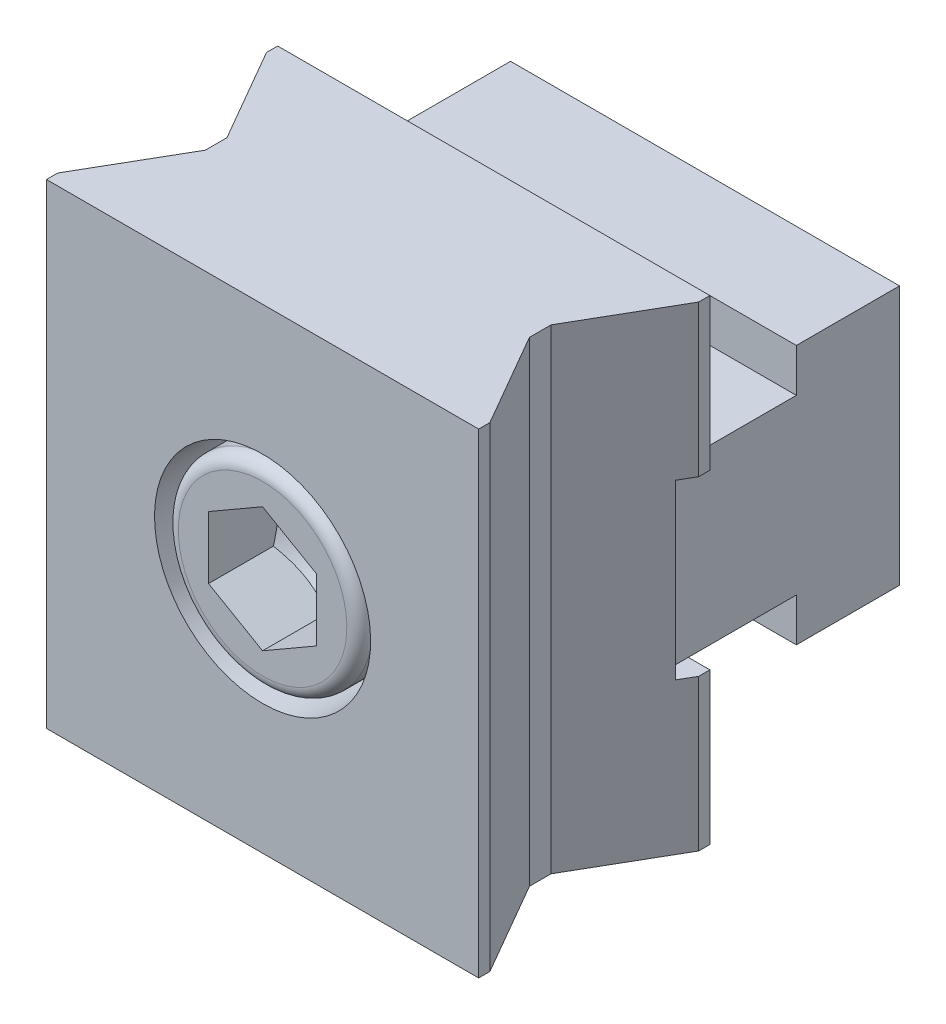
ISO-10303-21;
HEADER;
FILE_DESCRIPTION(('STEP AP214'),'2;1');
FILE_NAME('part.step','',(''),(''),'','','');
FILE_SCHEMA(('AUTOMOTIVE_DESIGN { 1 0 10303 214 1 1 1 1 }'));
ENDSEC;
DATA;
#1=APPLICATION_CONTEXT('core data for automotive mechanical design processes');
#2=APPLICATION_PROTOCOL_DEFINITION('international standard','automotive_design',2000,#1);
#3=PRODUCT_CONTEXT('',#1,'mechanical');
#4=PRODUCT('Part','Part','',(#3));
#5=PRODUCT_RELATED_PRODUCT_CATEGORY('part','',(#4));
#6=PRODUCT_DEFINITION_FORMATION('','',#4);
#7=PRODUCT_DEFINITION_CONTEXT('part definition',#1,'design');
#8=PRODUCT_DEFINITION('design','',#6,#7);
#9=PRODUCT_DEFINITION_SHAPE('','',#8);
#10=(LENGTH_UNIT() NAMED_UNIT(*) SI_UNIT(.MILLI.,.METRE.));
#11=(NAMED_UNIT(*) PLANE_ANGLE_UNIT() SI_UNIT($,.RADIAN.));
#12=(NAMED_UNIT(*) SI_UNIT($,.STERADIAN.) SOLID_ANGLE_UNIT());
#13=UNCERTAINTY_MEASURE_WITH_UNIT(LENGTH_MEASURE(1.E-05),#10,'distance_accuracy_value','');
#14=(GEOMETRIC_REPRESENTATION_CONTEXT(3) GLOBAL_UNCERTAINTY_ASSIGNED_CONTEXT((#13)) GLOBAL_UNIT_ASSIGNED_CONTEXT((#10,
#11,#12)) REPRESENTATION_CONTEXT('',''));
#15=CARTESIAN_POINT('',(0.,0.,0.));
#16=DIRECTION('',(0.,0.,1.));
#17=DIRECTION('',(1.,0.,0.));
#18=AXIS2_PLACEMENT_3D('',#15,#16,#17);
#19=CARTESIAN_POINT('',(0.,0.,-7.7875));
#20=DIRECTION('',(0.,0.,-1.));
#21=DIRECTION('',(-0.5,0.866025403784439,0.));
#22=AXIS2_PLACEMENT_3D('',#19,#20,#21);
#23=CYLINDRICAL_SURFACE('',#22,6.);
#24=CARTESIAN_POINT('',(0.,0.,2.00000000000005));
#25=DIRECTION('',(0.,0.,1.));
#26=DIRECTION('',(0.,-1.,0.));
#27=AXIS2_PLACEMENT_3D('',#24,#25,#26);
#28=CIRCLE('',#27,6.);
#29=CARTESIAN_POINT('',(0.,-5.99999999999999,2.00000000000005));
#30=VERTEX_POINT('',#29);
#31=EDGE_CURVE('E9',#30,#30,#28,.F.);
#32=ORIENTED_EDGE('',*,*,#31,.F.);
#33=EDGE_LOOP('',(#32));
#34=FACE_BOUND('',#33,.T.);
#35=CARTESIAN_POINT('',(0.,0.,2.4));
#36=DIRECTION('',(0.,0.,1.));
#37=DIRECTION('',(0.,-1.,0.));
#38=AXIS2_PLACEMENT_3D('',#35,#36,#37);
#39=CIRCLE('',#38,6.);
#40=CARTESIAN_POINT('',(0.,-5.99999999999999,2.4));
#41=VERTEX_POINT('',#40);
#42=EDGE_CURVE('E312',#41,#41,#39,.F.);
#43=ORIENTED_EDGE('',*,*,#42,.T.);
#44=EDGE_LOOP('',(#43));
#45=FACE_BOUND('',#44,.T.);
#46=ADVANCED_FACE('F14',(#34,#45),#23,.T.);
#47=CARTESIAN_POINT('',(-1.5,2.59807621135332,-20.6));
#48=DIRECTION('',(0.,0.,-1.));
#49=DIRECTION('',(-0.5,0.866025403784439,0.));
#50=AXIS2_PLACEMENT_3D('',#47,#48,#49);
#51=PLANE('',#50);
#52=CARTESIAN_POINT('',(0.,0.,-20.6000000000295));
#53=DIRECTION('',(0.,0.,1.));
#54=DIRECTION('',(0.866025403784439,0.5,0.));
#55=AXIS2_PLACEMENT_3D('',#52,#53,#54);
#56=CIRCLE('',#55,4.92646249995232);
#57=CARTESIAN_POINT('',(4.2664416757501,2.46323124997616,-20.6000000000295));
#58=VERTEX_POINT('',#57);
#59=EDGE_CURVE('E1086',#58,#58,#56,.T.);
#60=ORIENTED_EDGE('',*,*,#59,.F.);
#61=EDGE_LOOP('',(#60));
#62=FACE_BOUND('',#61,.T.);
#63=ADVANCED_FACE('F556',(#62),#51,.T.);
#64=CARTESIAN_POINT('',(0.,0.,-19.5264625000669));
#65=DIRECTION('',(0.,0.,1.));
#66=DIRECTION('',(0.866025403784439,0.5,0.));
#67=AXIS2_PLACEMENT_3D('',#64,#65,#66);
#68=CONICAL_SURFACE('',#67,5.99999999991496,0.785398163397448);
#69=ORIENTED_EDGE('',*,*,#59,.T.);
#70=EDGE_LOOP('',(#69));
#71=FACE_BOUND('',#70,.T.);
#72=CARTESIAN_POINT('',(0.,0.,-19.5264625));
#73=DIRECTION('',(0.,0.,-1.));
#74=DIRECTION('',(-0.5,0.866025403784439,0.));
#75=AXIS2_PLACEMENT_3D('',#72,#73,#74);
#76=CIRCLE('',#75,6.);
#77=CARTESIAN_POINT('',(-3.,5.19615242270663,-19.5264625));
#78=VERTEX_POINT('',#77);
#79=EDGE_CURVE('E24',#78,#78,#76,.F.);
#80=ORIENTED_EDGE('',*,*,#79,.F.);
#81=EDGE_LOOP('',(#80));
#82=FACE_BOUND('',#81,.T.);
#83=ADVANCED_FACE('F500',(#71,#82),#68,.T.);
#84=CARTESIAN_POINT('',(0.,0.,15.4199999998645));
#85=DIRECTION('',(0.,0.,1.));
#86=DIRECTION('',(0.866025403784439,0.5,0.));
#87=AXIS2_PLACEMENT_3D('',#84,#85,#86);
#88=CONICAL_SURFACE('',#87,5.80814370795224,1.04719755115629);
#89=CARTESIAN_POINT('',(5.68499240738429E-11,-9.84440393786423E-11,12.0666666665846));
#90=VERTEX_POINT('',#89);
#91=VERTEX_LOOP('',#90);
#92=FACE_BOUND('',#91,.T.);
#93=CARTESIAN_POINT('',(2.4304776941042E-11,5.77350269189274,15.3999999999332));
#94=CARTESIAN_POINT('',(-0.219731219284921,5.64664081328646,15.3267433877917));
#95=CARTESIAN_POINT('',(-0.441341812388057,5.5186938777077,15.2601139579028));
#96=CARTESIAN_POINT('',(-0.888400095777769,5.26058465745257,15.1438136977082));
#97=CARTESIAN_POINT('',(-1.11385572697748,5.13041778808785,15.0941840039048));
#98=CARTESIAN_POINT('',(-1.56200735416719,4.87167732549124,15.0169443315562));
#99=CARTESIAN_POINT('',(-1.78463357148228,4.74314401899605,14.9888198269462));
#100=CARTESIAN_POINT('',(-2.11935570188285,4.54989210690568,14.9636032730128));
#101=CARTESIAN_POINT('',(-2.23100606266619,4.48543074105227,14.9580247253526));
#102=CARTESIAN_POINT('',(-2.45440985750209,4.35644849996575,14.9526191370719));
#103=CARTESIAN_POINT('',(-2.5661632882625,4.29192762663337,14.9527919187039));
#104=CARTESIAN_POINT('',(-2.87231037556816,4.11517352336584,14.9611797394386));
#105=CARTESIAN_POINT('',(-3.06660250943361,4.00299890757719,14.975256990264));
#106=CARTESIAN_POINT('',(-3.45389732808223,3.77939413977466,15.0198894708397));
#107=CARTESIAN_POINT('',(-3.64689865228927,3.66796477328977,15.0504599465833));
#108=CARTESIAN_POINT('',(-4.03497329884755,3.44390977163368,15.1268756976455));
#109=CARTESIAN_POINT('',(-4.22999766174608,3.33131240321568,15.1730446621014));
#110=CARTESIAN_POINT('',(-4.61713844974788,3.10779656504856,15.2778288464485));
#111=CARTESIAN_POINT('',(-4.80925983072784,2.9968752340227,15.3364194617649));
#112=CARTESIAN_POINT('',(-5.0000000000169,2.88675134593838,15.3999999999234));
#113=B_SPLINE_CURVE_WITH_KNOTS('',3,(#93,#94,#95,#96,#97,#98,#99,#100,#101,#102,#103,#104,#105,
#106,#107,#108,#109,#110,#111,#112),.UNSPECIFIED.,.F.,.F.,(4,2,2,2,2,2,2,2,2,4),(0.,
0.792540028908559,1.58698454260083,2.36176901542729,2.7487873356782,3.13579369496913,
3.8094609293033,4.48375195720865,5.17299552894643,5.86088640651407),.UNSPECIFIED.);
#114=CARTESIAN_POINT('',(0.,5.77350269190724,15.399999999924));
#115=VERTEX_POINT('',#114);
#116=CARTESIAN_POINT('',(-5.0000000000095,2.88675134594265,15.3999999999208));
#117=VERTEX_POINT('',#116);
#118=EDGE_CURVE('E315',#115,#117,#113,.T.);
#119=ORIENTED_EDGE('',*,*,#118,.T.);
#120=CARTESIAN_POINT('',(-4.99999999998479,2.88675134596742,15.3999999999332));
#121=CARTESIAN_POINT('',(-4.99999999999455,2.63302758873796,15.3267433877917));
#122=CARTESIAN_POINT('',(-4.99999999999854,2.37713371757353,15.2601139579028));
#123=CARTESIAN_POINT('',(-5.00000000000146,1.86091527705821,15.1438136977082));
#124=CARTESIAN_POINT('',(-5.00000000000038,1.60058153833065,15.0941840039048));
#125=CARTESIAN_POINT('',(-4.99999999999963,1.08310061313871,15.0169443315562));
#126=CARTESIAN_POINT('',(-4.99999999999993,0.826034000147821,14.9888198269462));
#127=CARTESIAN_POINT('',(-5.00000000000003,0.439530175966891,14.9636032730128));
#128=CARTESIAN_POINT('',(-5.00000000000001,0.31060744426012,14.9580247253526));
#129=CARTESIAN_POINT('',(-4.99999999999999,0.052642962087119,14.9526191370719));
#130=CARTESIAN_POINT('',(-5.,-0.076398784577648,14.9527919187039));
#131=CARTESIAN_POINT('',(-5.00000000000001,-0.429906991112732,14.9611797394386));
#132=CARTESIAN_POINT('',(-5.,-0.654256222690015,14.975256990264));
#133=CARTESIAN_POINT('',(-5.,-1.10146575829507,15.0198894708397));
#134=CARTESIAN_POINT('',(-5.,-1.32432449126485,15.0504599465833));
#135=CARTESIAN_POINT('',(-5.,-1.77243449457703,15.1268756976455));
#136=CARTESIAN_POINT('',(-5.,-1.99762923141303,15.1730446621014));
#137=CARTESIAN_POINT('',(-5.,-2.44466090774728,15.2778288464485));
#138=CARTESIAN_POINT('',(-5.,-2.666503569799,15.3364194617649));
#139=CARTESIAN_POINT('',(-5.,-2.88675134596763,15.3999999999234));
#140=B_SPLINE_CURVE_WITH_KNOTS('',3,(#120,#121,#122,#123,#124,#125,#126,#127,#128,#129,#130,
#131,#132,#133,#134,#135,#136,#137,#138,#139),.UNSPECIFIED.,.F.,.F.,(4,2,2,2,2,2,2,2,2,4),(0.,
0.792540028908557,1.58698454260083,2.36176901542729,2.7487873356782,3.13579369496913,
3.8094609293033,4.48375195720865,5.17299552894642,5.86088640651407),.UNSPECIFIED.);
#141=CARTESIAN_POINT('',(-5.0000000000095,-2.8867513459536,15.399999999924));
#142=VERTEX_POINT('',#141);
#143=EDGE_CURVE('E509',#117,#142,#140,.T.);
#144=ORIENTED_EDGE('',*,*,#143,.T.);
#145=CARTESIAN_POINT('',(-5.00000000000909,-2.8867513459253,15.3999999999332));
#146=CARTESIAN_POINT('',(-4.78026878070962,-3.01361322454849,15.3267433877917));
#147=CARTESIAN_POINT('',(-4.55865818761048,-3.14156016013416,15.2601139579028));
#148=CARTESIAN_POINT('',(-4.11159990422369,-3.39966938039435,15.1438136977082));
#149=CARTESIAN_POINT('',(-3.88614427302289,-3.52983624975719,15.0941840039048));
#150=CARTESIAN_POINT('',(-3.43799264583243,-3.78857671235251,15.0169443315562));
#151=CARTESIAN_POINT('',(-3.21536642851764,-3.91711001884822,14.9888198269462));
#152=CARTESIAN_POINT('',(-2.88064429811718,-4.11036193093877,14.9636032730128));
#153=CARTESIAN_POINT('',(-2.76899393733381,-4.17482329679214,14.9580247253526));
#154=CARTESIAN_POINT('',(-2.54559014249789,-4.30380553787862,14.9526191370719));
#155=CARTESIAN_POINT('',(-2.43383671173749,-4.36832641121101,14.9527919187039));
#156=CARTESIAN_POINT('',(-2.12768962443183,-4.54508051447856,14.9611797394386));
#157=CARTESIAN_POINT('',(-1.93339749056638,-4.6572551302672,14.975256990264));
#158=CARTESIAN_POINT('',(-1.54610267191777,-4.88085989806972,15.0198894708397));
#159=CARTESIAN_POINT('',(-1.35310134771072,-4.99228926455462,15.0504599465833));
#160=CARTESIAN_POINT('',(-0.965026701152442,-5.21634426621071,15.1268756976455));
#161=CARTESIAN_POINT('',(-0.770002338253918,-5.3289416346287,15.1730446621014));
#162=CARTESIAN_POINT('',(-0.382861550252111,-5.55245747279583,15.2778288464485));
#163=CARTESIAN_POINT('',(-0.190740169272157,-5.66337880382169,15.3364194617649));
#164=CARTESIAN_POINT('',(1.6904880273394E-11,-5.77350269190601,15.3999999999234));
#165=B_SPLINE_CURVE_WITH_KNOTS('',3,(#145,#146,#147,#148,#149,#150,#151,#152,#153,#154,#155,
#156,#157,#158,#159,#160,#161,#162,#163,#164),.UNSPECIFIED.,.F.,.F.,(4,2,2,2,2,2,2,2,2,4),(0.,
0.792540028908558,1.58698454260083,2.36176901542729,2.7487873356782,3.13579369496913,
3.8094609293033,4.48375195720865,5.17299552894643,5.86088640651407),.UNSPECIFIED.);
#166=CARTESIAN_POINT('',(0.,-5.77350269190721,15.399999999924));
#167=VERTEX_POINT('',#166);
#168=EDGE_CURVE('E518',#142,#167,#165,.T.);
#169=ORIENTED_EDGE('',*,*,#168,.T.);
#170=CARTESIAN_POINT('',(-2.43000064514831E-11,-5.77350269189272,15.3999999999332));
#171=CARTESIAN_POINT('',(0.219731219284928,-5.64664081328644,15.3267433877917));
#172=CARTESIAN_POINT('',(0.441341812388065,-5.51869387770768,15.2601139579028));
#173=CARTESIAN_POINT('',(0.888400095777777,-5.26058465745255,15.1438136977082));
#174=CARTESIAN_POINT('',(1.11385572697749,-5.13041778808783,15.0941840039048));
#175=CARTESIAN_POINT('',(1.5620073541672,-4.87167732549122,15.0169443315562));
#176=CARTESIAN_POINT('',(1.78463357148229,-4.74314401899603,14.9888198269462));
#177=CARTESIAN_POINT('',(2.11935570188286,-4.54989210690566,14.9636032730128));
#178=CARTESIAN_POINT('',(2.2310060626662,-4.48543074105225,14.9580247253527));
#179=CARTESIAN_POINT('',(2.4544098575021,-4.35644849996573,14.9526191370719));
#180=CARTESIAN_POINT('',(2.56616328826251,-4.29192762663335,14.9527919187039));
#181=CARTESIAN_POINT('',(2.87231037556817,-4.11517352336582,14.9611797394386));
#182=CARTESIAN_POINT('',(3.06660250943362,-4.00299890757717,14.975256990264));
#183=CARTESIAN_POINT('',(3.45389732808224,-3.77939413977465,15.0198894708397));
#184=CARTESIAN_POINT('',(3.64689865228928,-3.66796477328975,15.0504599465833));
#185=CARTESIAN_POINT('',(4.03497329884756,-3.44390977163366,15.1268756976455));
#186=CARTESIAN_POINT('',(4.22999766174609,-3.33131240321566,15.1730446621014));
#187=CARTESIAN_POINT('',(4.61713844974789,-3.10779656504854,15.2778288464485));
#188=CARTESIAN_POINT('',(4.80925983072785,-2.99687523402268,15.3364194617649));
#189=CARTESIAN_POINT('',(5.00000000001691,-2.88675134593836,15.3999999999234));
#190=B_SPLINE_CURVE_WITH_KNOTS('',3,(#170,#171,#172,#173,#174,#175,#176,#177,#178,#179,#180,
#181,#182,#183,#184,#185,#186,#187,#188,#189),.UNSPECIFIED.,.F.,.F.,(4,2,2,2,2,2,2,2,2,4),(0.,
0.792540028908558,1.58698454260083,2.36176901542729,2.7487873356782,3.13579369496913,
3.80946092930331,4.48375195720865,5.17299552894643,5.86088640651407),.UNSPECIFIED.);
#191=CARTESIAN_POINT('',(5.00000000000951,-2.8867513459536,15.399999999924));
#192=VERTEX_POINT('',#191);
#193=EDGE_CURVE('E525',#167,#192,#190,.T.);
#194=ORIENTED_EDGE('',*,*,#193,.T.);
#195=CARTESIAN_POINT('',(4.99999999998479,-2.8867513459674,15.3999999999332));
#196=CARTESIAN_POINT('',(4.99999999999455,-2.63302758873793,15.3267433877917));
#197=CARTESIAN_POINT('',(4.99999999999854,-2.3771337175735,15.2601139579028));
#198=CARTESIAN_POINT('',(5.00000000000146,-1.86091527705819,15.1438136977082));
#199=CARTESIAN_POINT('',(5.00000000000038,-1.60058153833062,15.0941840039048));
#200=CARTESIAN_POINT('',(4.99999999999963,-1.08310061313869,15.0169443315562));
#201=CARTESIAN_POINT('',(4.99999999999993,-0.826034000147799,14.9888198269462));
#202=CARTESIAN_POINT('',(5.00000000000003,-0.439530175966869,14.9636032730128));
#203=CARTESIAN_POINT('',(5.00000000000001,-0.310607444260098,14.9580247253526));
#204=CARTESIAN_POINT('',(4.99999999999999,-0.0526429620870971,14.9526191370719));
#205=CARTESIAN_POINT('',(5.,0.0763987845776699,14.9527919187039));
#206=CARTESIAN_POINT('',(5.00000000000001,0.429906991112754,14.9611797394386));
#207=CARTESIAN_POINT('',(5.,0.654256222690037,14.975256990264));
#208=CARTESIAN_POINT('',(5.,1.10146575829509,15.0198894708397));
#209=CARTESIAN_POINT('',(5.,1.32432449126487,15.0504599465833));
#210=CARTESIAN_POINT('',(5.,1.77243449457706,15.1268756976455));
#211=CARTESIAN_POINT('',(5.,1.99762923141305,15.1730446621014));
#212=CARTESIAN_POINT('',(5.,2.44466090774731,15.2778288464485));
#213=CARTESIAN_POINT('',(5.,2.66650356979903,15.3364194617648));
#214=CARTESIAN_POINT('',(5.,2.88675134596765,15.3999999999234));
#215=B_SPLINE_CURVE_WITH_KNOTS('',3,(#195,#196,#197,#198,#199,#200,#201,#202,#203,#204,#205,
#206,#207,#208,#209,#210,#211,#212,#213,#214),.UNSPECIFIED.,.F.,.F.,(4,2,2,2,2,2,2,2,2,4),(0.,
0.792540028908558,1.58698454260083,2.36176901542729,2.7487873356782,3.13579369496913,
3.8094609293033,4.48375195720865,5.17299552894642,5.86088640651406),.UNSPECIFIED.);
#216=CARTESIAN_POINT('',(5.00000000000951,2.88675134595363,15.399999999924));
#217=VERTEX_POINT('',#216);
#218=EDGE_CURVE('E531',#192,#217,#215,.T.);
#219=ORIENTED_EDGE('',*,*,#218,.T.);
#220=CARTESIAN_POINT('',(5.0000000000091,2.88675134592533,15.3999999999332));
#221=CARTESIAN_POINT('',(4.78026878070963,3.01361322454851,15.3267433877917));
#222=CARTESIAN_POINT('',(4.55865818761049,3.14156016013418,15.2601139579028));
#223=CARTESIAN_POINT('',(4.1115999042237,3.39966938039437,15.1438136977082));
#224=CARTESIAN_POINT('',(3.8861442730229,3.52983624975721,15.0941840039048));
#225=CARTESIAN_POINT('',(3.43799264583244,3.78857671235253,15.0169443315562));
#226=CARTESIAN_POINT('',(3.21536642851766,3.91711001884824,14.9888198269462));
#227=CARTESIAN_POINT('',(2.88064429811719,4.11036193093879,14.9636032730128));
#228=CARTESIAN_POINT('',(2.76899393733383,4.17482329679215,14.9580247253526));
#229=CARTESIAN_POINT('',(2.5455901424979,4.30380553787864,14.9526191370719));
#230=CARTESIAN_POINT('',(2.4338367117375,4.36832641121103,14.9527919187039));
#231=CARTESIAN_POINT('',(2.12768962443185,4.54508051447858,14.9611797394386));
#232=CARTESIAN_POINT('',(1.9333974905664,4.65725513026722,14.975256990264));
#233=CARTESIAN_POINT('',(1.54610267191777,4.88085989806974,15.0198894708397));
#234=CARTESIAN_POINT('',(1.35310134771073,4.99228926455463,15.0504599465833));
#235=CARTESIAN_POINT('',(0.96502670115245,5.21634426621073,15.1268756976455));
#236=CARTESIAN_POINT('',(0.770002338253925,5.32894163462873,15.1730446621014));
#237=CARTESIAN_POINT('',(0.382861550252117,5.55245747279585,15.2778288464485));
#238=CARTESIAN_POINT('',(0.190740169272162,5.66337880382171,15.3364194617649));
#239=CARTESIAN_POINT('',(-1.69001097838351E-11,5.77350269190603,15.3999999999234));
#240=B_SPLINE_CURVE_WITH_KNOTS('',3,(#220,#221,#222,#223,#224,#225,#226,#227,#228,#229,#230,
#231,#232,#233,#234,#235,#236,#237,#238,#239),.UNSPECIFIED.,.F.,.F.,(4,2,2,2,2,2,2,2,2,4),(0.,
0.792540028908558,1.58698454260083,2.36176901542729,2.7487873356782,3.13579369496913,
3.8094609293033,4.48375195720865,5.17299552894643,5.86088640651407),.UNSPECIFIED.);
#241=EDGE_CURVE('E487',#217,#115,#240,.T.);
#242=ORIENTED_EDGE('',*,*,#241,.T.);
#243=EDGE_LOOP('',(#119,#144,#169,#194,#219,#242));
#244=FACE_BOUND('',#243,.T.);
#245=ADVANCED_FACE('F496',(#92,#244),#88,.F.);
#246=CARTESIAN_POINT('',(0.,5.77350269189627,21.4));
#247=DIRECTION('',(-0.5,0.866025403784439,0.));
#248=DIRECTION('',(0.866025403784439,0.5,0.));
#249=AXIS2_PLACEMENT_3D('',#246,#247,#248);
#250=PLANE('',#249);
#251=DIRECTION('',(0.,0.,-1.));
#252=VECTOR('',#251,1.);
#253=CARTESIAN_POINT('',(0.,5.77350269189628,21.4));
#254=LINE('',#253,#252);
#255=CARTESIAN_POINT('',(0.,5.77350269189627,21.4));
#256=VERTEX_POINT('',#255);
#257=EDGE_CURVE('E486',#115,#256,#254,.F.);
#258=ORIENTED_EDGE('',*,*,#257,.T.);
#259=DIRECTION('',(0.866025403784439,0.5,0.));
#260=VECTOR('',#259,1.);
#261=CARTESIAN_POINT('',(-2.5,4.33012701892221,21.4));
#262=LINE('',#261,#260);
#263=CARTESIAN_POINT('',(-5.,2.88675134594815,21.4));
#264=VERTEX_POINT('',#263);
#265=EDGE_CURVE('E1068',#264,#256,#262,.T.);
#266=ORIENTED_EDGE('',*,*,#265,.F.);
#267=DIRECTION('',(0.,0.,-1.));
#268=VECTOR('',#267,1.);
#269=CARTESIAN_POINT('',(-5.,2.88675134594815,21.4));
#270=LINE('',#269,#268);
#271=EDGE_CURVE('E1054',#264,#117,#270,.T.);
#272=ORIENTED_EDGE('',*,*,#271,.T.);
#273=ORIENTED_EDGE('',*,*,#118,.F.);
#274=EDGE_LOOP('',(#258,#266,#272,#273));
#275=FACE_BOUND('',#274,.T.);
#276=ADVANCED_FACE('F494',(#275),#250,.F.);
#277=CARTESIAN_POINT('',(5.,2.88675134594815,21.4));
#278=DIRECTION('',(0.5,0.866025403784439,0.));
#279=DIRECTION('',(0.866025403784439,-0.5,0.));
#280=AXIS2_PLACEMENT_3D('',#277,#278,#279);
#281=PLANE('',#280);
#282=DIRECTION('',(0.,0.,-1.));
#283=VECTOR('',#282,1.);
#284=CARTESIAN_POINT('',(5.,2.88675134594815,21.4));
#285=LINE('',#284,#283);
#286=CARTESIAN_POINT('',(5.,2.88675134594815,21.4));
#287=VERTEX_POINT('',#286);
#288=EDGE_CURVE('E539',#217,#287,#285,.F.);
#289=ORIENTED_EDGE('',*,*,#288,.T.);
#290=DIRECTION('',(0.86602540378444,-0.5,0.));
#291=VECTOR('',#290,1.);
#292=CARTESIAN_POINT('',(0.,5.77350269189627,21.4));
#293=LINE('',#292,#291);
#294=EDGE_CURVE('E1071',#256,#287,#293,.T.);
#295=ORIENTED_EDGE('',*,*,#294,.F.);
#296=ORIENTED_EDGE('',*,*,#257,.F.);
#297=ORIENTED_EDGE('',*,*,#241,.F.);
#298=EDGE_LOOP('',(#289,#295,#296,#297));
#299=FACE_BOUND('',#298,.T.);
#300=ADVANCED_FACE('F544',(#299),#281,.F.);
#301=CARTESIAN_POINT('',(5.,-2.88675134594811,21.4));
#302=DIRECTION('',(1.,0.,0.));
#303=DIRECTION('',(0.,-1.,0.));
#304=AXIS2_PLACEMENT_3D('',#301,#302,#303);
#305=PLANE('',#304);
#306=DIRECTION('',(0.,0.,-1.));
#307=VECTOR('',#306,1.);
#308=CARTESIAN_POINT('',(5.,-2.88675134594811,21.4));
#309=LINE('',#308,#307);
#310=CARTESIAN_POINT('',(5.,-2.88675134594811,21.4));
#311=VERTEX_POINT('',#310);
#312=EDGE_CURVE('E538',#192,#311,#309,.F.);
#313=ORIENTED_EDGE('',*,*,#312,.T.);
#314=DIRECTION('',(0.,-1.,0.));
#315=VECTOR('',#314,1.);
#316=CARTESIAN_POINT('',(5.,2.88675134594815,21.4));
#317=LINE('',#316,#315);
#318=EDGE_CURVE('E1081',#287,#311,#317,.T.);
#319=ORIENTED_EDGE('',*,*,#318,.F.);
#320=ORIENTED_EDGE('',*,*,#288,.F.);
#321=ORIENTED_EDGE('',*,*,#218,.F.);
#322=EDGE_LOOP('',(#313,#319,#320,#321));
#323=FACE_BOUND('',#322,.T.);
#324=ADVANCED_FACE('F540',(#323),#305,.F.);
#325=CARTESIAN_POINT('',(0.,-5.77350269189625,21.4));
#326=DIRECTION('',(0.5,-0.866025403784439,0.));
#327=DIRECTION('',(-0.866025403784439,-0.5,0.));
#328=AXIS2_PLACEMENT_3D('',#325,#326,#327);
#329=PLANE('',#328);
#330=DIRECTION('',(0.,0.,-1.));
#331=VECTOR('',#330,1.);
#332=CARTESIAN_POINT('',(0.,-5.77350269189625,21.4));
#333=LINE('',#332,#331);
#334=CARTESIAN_POINT('',(0.,-5.77350269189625,21.4));
#335=VERTEX_POINT('',#334);
#336=EDGE_CURVE('E1063',#167,#335,#333,.F.);
#337=ORIENTED_EDGE('',*,*,#336,.T.);
#338=DIRECTION('',(0.866025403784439,0.5,0.));
#339=VECTOR('',#338,1.);
#340=CARTESIAN_POINT('',(2.5,-4.33012701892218,21.4));
#341=LINE('',#340,#339);
#342=EDGE_CURVE('E1078',#311,#335,#341,.F.);
#343=ORIENTED_EDGE('',*,*,#342,.F.);
#344=ORIENTED_EDGE('',*,*,#312,.F.);
#345=ORIENTED_EDGE('',*,*,#193,.F.);
#346=EDGE_LOOP('',(#337,#343,#344,#345));
#347=FACE_BOUND('',#346,.T.);
#348=ADVANCED_FACE('F543',(#347),#329,.F.);
#349=CARTESIAN_POINT('',(-5.,-2.88675134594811,21.4));
#350=DIRECTION('',(-0.5,-0.866025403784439,0.));
#351=DIRECTION('',(-0.866025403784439,0.5,0.));
#352=AXIS2_PLACEMENT_3D('',#349,#350,#351);
#353=PLANE('',#352);
#354=DIRECTION('',(0.,0.,-1.));
#355=VECTOR('',#354,1.);
#356=CARTESIAN_POINT('',(-5.,-2.88675134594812,21.4));
#357=LINE('',#356,#355);
#358=CARTESIAN_POINT('',(-5.,-2.88675134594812,21.4));
#359=VERTEX_POINT('',#358);
#360=EDGE_CURVE('E33',#142,#359,#357,.F.);
#361=ORIENTED_EDGE('',*,*,#360,.T.);
#362=DIRECTION('',(-0.866025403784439,0.5,0.));
#363=VECTOR('',#362,1.);
#364=CARTESIAN_POINT('',(0.,-5.77350269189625,21.4));
#365=LINE('',#364,#363);
#366=EDGE_CURVE('E1075',#335,#359,#365,.T.);
#367=ORIENTED_EDGE('',*,*,#366,.F.);
#368=ORIENTED_EDGE('',*,*,#336,.F.);
#369=ORIENTED_EDGE('',*,*,#168,.F.);
#370=EDGE_LOOP('',(#361,#367,#368,#369));
#371=FACE_BOUND('',#370,.T.);
#372=ADVANCED_FACE('F972',(#371),#353,.F.);
#373=CARTESIAN_POINT('',(-5.,2.88675134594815,21.4));
#374=DIRECTION('',(-1.,0.,0.));
#375=DIRECTION('',(0.,1.,0.));
#376=AXIS2_PLACEMENT_3D('',#373,#374,#375);
#377=PLANE('',#376);
#378=ORIENTED_EDGE('',*,*,#271,.F.);
#379=DIRECTION('',(0.,1.,0.));
#380=VECTOR('',#379,1.);
#381=CARTESIAN_POINT('',(-5.,-2.88675134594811,21.4));
#382=LINE('',#381,#380);
#383=EDGE_CURVE('E1072',#359,#264,#382,.T.);
#384=ORIENTED_EDGE('',*,*,#383,.F.);
#385=ORIENTED_EDGE('',*,*,#360,.F.);
#386=ORIENTED_EDGE('',*,*,#143,.F.);
#387=EDGE_LOOP('',(#378,#384,#385,#386));
#388=FACE_BOUND('',#387,.T.);
#389=ADVANCED_FACE('F963',(#388),#377,.F.);
#390=CARTESIAN_POINT('',(-3.69337567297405,6.39711431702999,21.4));
#391=DIRECTION('',(0.,0.,1.));
#392=DIRECTION('',(0.5,-0.866025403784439,0.));
#393=AXIS2_PLACEMENT_3D('',#390,#391,#392);
#394=PLANE('',#393);
#395=ORIENTED_EDGE('',*,*,#366,.T.);
#396=ORIENTED_EDGE('',*,*,#383,.T.);
#397=ORIENTED_EDGE('',*,*,#265,.T.);
#398=ORIENTED_EDGE('',*,*,#294,.T.);
#399=ORIENTED_EDGE('',*,*,#318,.T.);
#400=ORIENTED_EDGE('',*,*,#342,.T.);
#401=EDGE_LOOP('',(#395,#396,#397,#398,#399,#400));
#402=FACE_BOUND('',#401,.T.);
#403=CARTESIAN_POINT('',(0.,0.,21.4));
#404=DIRECTION('',(0.,0.,-1.));
#405=DIRECTION('',(-0.500000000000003,0.866025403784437,0.));
#406=AXIS2_PLACEMENT_3D('',#403,#404,#405);
#407=CIRCLE('',#406,7.80000000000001);
#408=CARTESIAN_POINT('',(-3.90000000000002,6.75499814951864,21.4));
#409=VERTEX_POINT('',#408);
#410=EDGE_CURVE('E1041',#409,#409,#407,.T.);
#411=ORIENTED_EDGE('',*,*,#410,.F.);
#412=EDGE_LOOP('',(#411));
#413=FACE_BOUND('',#412,.T.);
#414=ADVANCED_FACE('F954',(#402,#413),#394,.T.);
#415=CARTESIAN_POINT('',(0.,0.,20.2));
#416=DIRECTION('',(0.,0.,-1.));
#417=DIRECTION('',(-0.866025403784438,-0.500000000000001,0.));
#418=AXIS2_PLACEMENT_3D('',#415,#416,#417);
#419=TOROIDAL_SURFACE('',#418,7.80000000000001,1.2);
#420=CARTESIAN_POINT('',(0.,0.,20.2));
#421=DIRECTION('',(0.,0.,-1.));
#422=DIRECTION('',(-0.5,0.866025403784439,0.));
#423=AXIS2_PLACEMENT_3D('',#420,#421,#422);
#424=CIRCLE('',#423,9.);
#425=CARTESIAN_POINT('',(-4.49999999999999,7.79422863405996,20.2));
#426=VERTEX_POINT('',#425);
#427=EDGE_CURVE('E1089',#426,#426,#424,.T.);
#428=ORIENTED_EDGE('',*,*,#427,.F.);
#429=EDGE_LOOP('',(#428));
#430=FACE_BOUND('',#429,.T.);
#431=ORIENTED_EDGE('',*,*,#410,.T.);
#432=EDGE_LOOP('',(#431));
#433=FACE_BOUND('',#432,.T.);
#434=ADVANCED_FACE('F945',(#430,#433),#419,.T.);
#435=CARTESIAN_POINT('',(0.,0.,15.4));
#436=DIRECTION('',(0.,0.,-1.));
#437=DIRECTION('',(-0.5,0.866025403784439,0.));
#438=AXIS2_PLACEMENT_3D('',#435,#436,#437);
#439=CYLINDRICAL_SURFACE('',#438,9.);
#440=ORIENTED_EDGE('',*,*,#427,.T.);
#441=EDGE_LOOP('',(#440));
#442=FACE_BOUND('',#441,.T.);
#443=CARTESIAN_POINT('',(0.,0.,9.4));
#444=DIRECTION('',(0.,0.,-1.));
#445=DIRECTION('',(-0.5,0.866025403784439,0.));
#446=AXIS2_PLACEMENT_3D('',#443,#444,#445);
#447=CIRCLE('',#446,9.);
#448=CARTESIAN_POINT('',(-4.49999999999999,7.79422863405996,9.4));
#449=VERTEX_POINT('',#448);
#450=EDGE_CURVE('E1087',#449,#449,#447,.T.);
#451=ORIENTED_EDGE('',*,*,#450,.F.);
#452=EDGE_LOOP('',(#451));
#453=FACE_BOUND('',#452,.T.);
#454=ADVANCED_FACE('F745',(#442,#453),#439,.T.);
#455=CARTESIAN_POINT('',(-20.,-22.,20.3602540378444));
#456=DIRECTION('',(0.866025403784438,0.,0.5));
#457=DIRECTION('',(-0.5,0.,0.866025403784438));
#458=AXIS2_PLACEMENT_3D('',#455,#456,#457);
#459=PLANE('',#458);
#460=DIRECTION('',(0.,-1.,0.));
#461=VECTOR('',#460,1.);
#462=CARTESIAN_POINT('',(-15.,-22.,11.7));
#463=LINE('',#462,#461);
#464=CARTESIAN_POINT('',(-15.,-22.,11.7));
#465=VERTEX_POINT('',#464);
#466=CARTESIAN_POINT('',(-15.,22.,11.7));
#467=VERTEX_POINT('',#466);
#468=EDGE_CURVE('E409',#465,#467,#463,.F.);
#469=ORIENTED_EDGE('',*,*,#468,.F.);
#470=DIRECTION('',(-0.5,0.,0.866025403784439));
#471=VECTOR('',#470,1.);
#472=CARTESIAN_POINT('',(-15.,-22.,11.7));
#473=LINE('',#472,#471);
#474=CARTESIAN_POINT('',(-20.,-22.,20.3602540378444));
#475=VERTEX_POINT('',#474);
#476=EDGE_CURVE('E426',#465,#475,#473,.T.);
#477=ORIENTED_EDGE('',*,*,#476,.T.);
#478=DIRECTION('',(0.,-1.,0.));
#479=VECTOR('',#478,1.);
#480=CARTESIAN_POINT('',(-20.,11.,20.3602540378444));
#481=LINE('',#480,#479);
#482=CARTESIAN_POINT('',(-20.,22.,20.3602540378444));
#483=VERTEX_POINT('',#482);
#484=EDGE_CURVE('E417',#475,#483,#481,.F.);
#485=ORIENTED_EDGE('',*,*,#484,.T.);
#486=DIRECTION('',(-0.5,0.,0.866025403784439));
#487=VECTOR('',#486,1.);
#488=CARTESIAN_POINT('',(-15.,22.,11.7));
#489=LINE('',#488,#487);
#490=EDGE_CURVE('E455',#467,#483,#489,.T.);
#491=ORIENTED_EDGE('',*,*,#490,.F.);
#492=EDGE_LOOP('',(#469,#477,#485,#491));
#493=FACE_BOUND('',#492,.T.);
#494=ADVANCED_FACE('F657',(#493),#459,.F.);
#495=CARTESIAN_POINT('',(20.,-22.,20.3602540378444));
#496=DIRECTION('',(0.866025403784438,0.,-0.5));
#497=DIRECTION('',(0.5,0.,0.866025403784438));
#498=AXIS2_PLACEMENT_3D('',#495,#496,#497);
#499=PLANE('',#498);
#500=DIRECTION('',(-0.5,0.,-0.866025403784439));
#501=VECTOR('',#500,1.);
#502=CARTESIAN_POINT('',(20.,-22.,20.3602540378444));
#503=LINE('',#502,#501);
#504=CARTESIAN_POINT('',(20.,-22.,20.3602540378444));
#505=VERTEX_POINT('',#504);
#506=CARTESIAN_POINT('',(15.,-22.,11.7));
#507=VERTEX_POINT('',#506);
#508=EDGE_CURVE('E430',#505,#507,#503,.T.);
#509=ORIENTED_EDGE('',*,*,#508,.T.);
#510=DIRECTION('',(0.,-1.,0.));
#511=VECTOR('',#510,1.);
#512=CARTESIAN_POINT('',(15.,-22.,11.7));
#513=LINE('',#512,#511);
#514=CARTESIAN_POINT('',(15.,22.,11.7));
#515=VERTEX_POINT('',#514);
#516=EDGE_CURVE('E411',#515,#507,#513,.T.);
#517=ORIENTED_EDGE('',*,*,#516,.F.);
#518=DIRECTION('',(-0.5,0.,-0.866025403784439));
#519=VECTOR('',#518,1.);
#520=CARTESIAN_POINT('',(20.,22.,20.3602540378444));
#521=LINE('',#520,#519);
#522=CARTESIAN_POINT('',(20.,22.,20.3602540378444));
#523=VERTEX_POINT('',#522);
#524=EDGE_CURVE('E464',#523,#515,#521,.T.);
#525=ORIENTED_EDGE('',*,*,#524,.F.);
#526=DIRECTION('',(0.,-1.,0.));
#527=VECTOR('',#526,1.);
#528=CARTESIAN_POINT('',(20.,11.,20.3602540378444));
#529=LINE('',#528,#527);
#530=EDGE_CURVE('E438',#505,#523,#529,.F.);
#531=ORIENTED_EDGE('',*,*,#530,.F.);
#532=EDGE_LOOP('',(#509,#517,#525,#531));
#533=FACE_BOUND('',#532,.T.);
#534=ADVANCED_FACE('F689',(#533),#499,.T.);
#535=CARTESIAN_POINT('',(-20.,11.,9.9));
#536=DIRECTION('',(1.,0.,0.));
#537=DIRECTION('',(0.,0.,1.));
#538=AXIS2_PLACEMENT_3D('',#535,#536,#537);
#539=PLANE('',#538);
#540=DIRECTION('',(0.,0.,1.));
#541=VECTOR('',#540,1.);
#542=CARTESIAN_POINT('',(-20.,-22.,-1.6));
#543=LINE('',#542,#541);
#544=CARTESIAN_POINT('',(-20.,-22.,21.4));
#545=VERTEX_POINT('',#544);
#546=EDGE_CURVE('E428',#475,#545,#543,.T.);
#547=ORIENTED_EDGE('',*,*,#546,.T.);
#548=DIRECTION('',(0.,-1.,0.));
#549=VECTOR('',#548,1.);
#550=CARTESIAN_POINT('',(-20.,22.,21.4));
#551=LINE('',#550,#549);
#552=CARTESIAN_POINT('',(-20.,22.,21.4));
#553=VERTEX_POINT('',#552);
#554=EDGE_CURVE('E331',#553,#545,#551,.T.);
#555=ORIENTED_EDGE('',*,*,#554,.F.);
#556=DIRECTION('',(0.,0.,1.));
#557=VECTOR('',#556,1.);
#558=CARTESIAN_POINT('',(-20.,22.,-1.6));
#559=LINE('',#558,#557);
#560=EDGE_CURVE('E458',#483,#553,#559,.T.);
#561=ORIENTED_EDGE('',*,*,#560,.F.);
#562=ORIENTED_EDGE('',*,*,#484,.F.);
#563=EDGE_LOOP('',(#547,#555,#561,#562));
#564=FACE_BOUND('',#563,.T.);
#565=ADVANCED_FACE('F696',(#564),#539,.F.);
#566=CARTESIAN_POINT('',(15.,-22.,11.7));
#567=DIRECTION('',(1.,0.,0.));
#568=DIRECTION('',(0.,0.,1.));
#569=AXIS2_PLACEMENT_3D('',#566,#567,#568);
#570=PLANE('',#569);
#571=DIRECTION('',(0.,0.,1.));
#572=VECTOR('',#571,1.);
#573=CARTESIAN_POINT('',(15.,-22.,-1.6));
#574=LINE('',#573,#572);
#575=CARTESIAN_POINT('',(15.,-22.,9.7));
#576=VERTEX_POINT('',#575);
#577=EDGE_CURVE('E432',#507,#576,#574,.F.);
#578=ORIENTED_EDGE('',*,*,#577,.T.);
#579=DIRECTION('',(0.,-1.,0.));
#580=VECTOR('',#579,1.);
#581=CARTESIAN_POINT('',(15.,-22.,9.7));
#582=LINE('',#581,#580);
#583=CARTESIAN_POINT('',(15.,22.,9.7));
#584=VERTEX_POINT('',#583);
#585=EDGE_CURVE('E414',#576,#584,#582,.F.);
#586=ORIENTED_EDGE('',*,*,#585,.T.);
#587=DIRECTION('',(0.,0.,1.));
#588=VECTOR('',#587,1.);
#589=CARTESIAN_POINT('',(15.,22.,-1.6));
#590=LINE('',#589,#588);
#591=EDGE_CURVE('E332',#515,#584,#590,.F.);
#592=ORIENTED_EDGE('',*,*,#591,.F.);
#593=ORIENTED_EDGE('',*,*,#516,.T.);
#594=EDGE_LOOP('',(#578,#586,#592,#593));
#595=FACE_BOUND('',#594,.T.);
#596=ADVANCED_FACE('F685',(#595),#570,.T.);
#597=CARTESIAN_POINT('',(-20.,22.,-1.6));
#598=DIRECTION('',(0.,1.,0.));
#599=DIRECTION('',(0.,0.,1.));
#600=AXIS2_PLACEMENT_3D('',#597,#598,#599);
#601=PLANE('',#600);
#602=ORIENTED_EDGE('',*,*,#524,.T.);
#603=ORIENTED_EDGE('',*,*,#591,.T.);
#604=DIRECTION('',(0.5,0.,-0.866025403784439));
#605=VECTOR('',#604,1.);
#606=CARTESIAN_POINT('',(15.,22.,9.7));
#607=LINE('',#606,#605);
#608=CARTESIAN_POINT('',(20.,22.,1.03974596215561));
#609=VERTEX_POINT('',#608);
#610=EDGE_CURVE('E443',#584,#609,#607,.T.);
#611=ORIENTED_EDGE('',*,*,#610,.T.);
#612=DIRECTION('',(0.,0.,1.));
#613=VECTOR('',#612,1.);
#614=CARTESIAN_POINT('',(20.,22.,9.9));
#615=LINE('',#614,#613);
#616=CARTESIAN_POINT('',(20.,22.,0.));
#617=VERTEX_POINT('',#616);
#618=EDGE_CURVE('E344',#617,#609,#615,.T.);
#619=ORIENTED_EDGE('',*,*,#618,.F.);
#620=DIRECTION('',(1.,0.,0.));
#621=VECTOR('',#620,1.);
#622=CARTESIAN_POINT('',(-20.,22.,0.));
#623=LINE('',#622,#621);
#624=CARTESIAN_POINT('',(-20.,22.,0.));
#625=VERTEX_POINT('',#624);
#626=EDGE_CURVE('E446',#617,#625,#623,.F.);
#627=ORIENTED_EDGE('',*,*,#626,.T.);
#628=DIRECTION('',(0.,0.,1.));
#629=VECTOR('',#628,1.);
#630=CARTESIAN_POINT('',(-20.,22.,9.9));
#631=LINE('',#630,#629);
#632=CARTESIAN_POINT('',(-20.,22.,1.03974596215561));
#633=VERTEX_POINT('',#632);
#634=EDGE_CURVE('E358',#625,#633,#631,.T.);
#635=ORIENTED_EDGE('',*,*,#634,.T.);
#636=DIRECTION('',(0.5,0.,0.866025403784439));
#637=VECTOR('',#636,1.);
#638=CARTESIAN_POINT('',(-20.,22.,1.03974596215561));
#639=LINE('',#638,#637);
#640=CARTESIAN_POINT('',(-15.,22.,9.7));
#641=VERTEX_POINT('',#640);
#642=EDGE_CURVE('E449',#633,#641,#639,.T.);
#643=ORIENTED_EDGE('',*,*,#642,.T.);
#644=DIRECTION('',(0.,0.,1.));
#645=VECTOR('',#644,1.);
#646=CARTESIAN_POINT('',(-15.,22.,-1.6));
#647=LINE('',#646,#645);
#648=EDGE_CURVE('E452',#641,#467,#647,.T.);
#649=ORIENTED_EDGE('',*,*,#648,.T.);
#650=ORIENTED_EDGE('',*,*,#490,.T.);
#651=ORIENTED_EDGE('',*,*,#560,.T.);
#652=DIRECTION('',(1.,0.,0.));
#653=VECTOR('',#652,1.);
#654=CARTESIAN_POINT('',(-20.,22.,21.4));
#655=LINE('',#654,#653);
#656=CARTESIAN_POINT('',(20.,22.,21.4));
#657=VERTEX_POINT('',#656);
#658=EDGE_CURVE('E335',#657,#553,#655,.F.);
#659=ORIENTED_EDGE('',*,*,#658,.F.);
#660=DIRECTION('',(0.,0.,1.));
#661=VECTOR('',#660,1.);
#662=CARTESIAN_POINT('',(20.,22.,-1.6));
#663=LINE('',#662,#661);
#664=EDGE_CURVE('E461',#657,#523,#663,.F.);
#665=ORIENTED_EDGE('',*,*,#664,.T.);
#666=EDGE_LOOP('',(#602,#603,#611,#619,#627,#635,#643,#649,#650,#651,#659,#665));
#667=FACE_BOUND('',#666,.T.);
#668=ADVANCED_FACE('F661',(#667),#601,.T.);
#669=CARTESIAN_POINT('',(-15.,-22.,11.7));
#670=DIRECTION('',(1.,0.,0.));
#671=DIRECTION('',(0.,0.,1.));
#672=AXIS2_PLACEMENT_3D('',#669,#670,#671);
#673=PLANE('',#672);
#674=DIRECTION('',(0.,-1.,0.));
#675=VECTOR('',#674,1.);
#676=CARTESIAN_POINT('',(-15.,-22.,9.7));
#677=LINE('',#676,#675);
#678=CARTESIAN_POINT('',(-15.,-22.,9.7));
#679=VERTEX_POINT('',#678);
#680=EDGE_CURVE('E407',#679,#641,#677,.F.);
#681=ORIENTED_EDGE('',*,*,#680,.F.);
#682=DIRECTION('',(0.,0.,1.));
#683=VECTOR('',#682,1.);
#684=CARTESIAN_POINT('',(-15.,-22.,-1.6));
#685=LINE('',#684,#683);
#686=EDGE_CURVE('E424',#679,#465,#685,.T.);
#687=ORIENTED_EDGE('',*,*,#686,.T.);
#688=ORIENTED_EDGE('',*,*,#468,.T.);
#689=ORIENTED_EDGE('',*,*,#648,.F.);
#690=EDGE_LOOP('',(#681,#687,#688,#689));
#691=FACE_BOUND('',#690,.T.);
#692=ADVANCED_FACE('F653',(#691),#673,.F.);
#693=CARTESIAN_POINT('',(-20.,-22.,-1.6));
#694=DIRECTION('',(0.,1.,0.));
#695=DIRECTION('',(0.,0.,1.));
#696=AXIS2_PLACEMENT_3D('',#693,#694,#695);
#697=PLANE('',#696);
#698=ORIENTED_EDGE('',*,*,#577,.F.);
#699=ORIENTED_EDGE('',*,*,#508,.F.);
#700=DIRECTION('',(0.,0.,1.));
#701=VECTOR('',#700,1.);
#702=CARTESIAN_POINT('',(20.,-22.,9.9));
#703=LINE('',#702,#701);
#704=CARTESIAN_POINT('',(20.,-22.,21.4));
#705=VERTEX_POINT('',#704);
#706=EDGE_CURVE('E440',#705,#505,#703,.F.);
#707=ORIENTED_EDGE('',*,*,#706,.F.);
#708=DIRECTION('',(1.,0.,0.));
#709=VECTOR('',#708,1.);
#710=CARTESIAN_POINT('',(-20.,-22.,21.4));
#711=LINE('',#710,#709);
#712=EDGE_CURVE('E471',#545,#705,#711,.T.);
#713=ORIENTED_EDGE('',*,*,#712,.F.);
#714=ORIENTED_EDGE('',*,*,#546,.F.);
#715=ORIENTED_EDGE('',*,*,#476,.F.);
#716=ORIENTED_EDGE('',*,*,#686,.F.);
#717=DIRECTION('',(0.5,0.,0.866025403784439));
#718=VECTOR('',#717,1.);
#719=CARTESIAN_POINT('',(-20.,-22.,1.03974596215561));
#720=LINE('',#719,#718);
#721=CARTESIAN_POINT('',(-20.,-22.,1.03974596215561));
#722=VERTEX_POINT('',#721);
#723=EDGE_CURVE('E422',#722,#679,#720,.T.);
#724=ORIENTED_EDGE('',*,*,#723,.F.);
#725=DIRECTION('',(0.,0.,1.));
#726=VECTOR('',#725,1.);
#727=CARTESIAN_POINT('',(-20.,-22.,9.9));
#728=LINE('',#727,#726);
#729=CARTESIAN_POINT('',(-20.,-22.,0.));
#730=VERTEX_POINT('',#729);
#731=EDGE_CURVE('E360',#722,#730,#728,.F.);
#732=ORIENTED_EDGE('',*,*,#731,.T.);
#733=DIRECTION('',(1.,0.,0.));
#734=VECTOR('',#733,1.);
#735=CARTESIAN_POINT('',(-20.,-22.,0.));
#736=LINE('',#735,#734);
#737=CARTESIAN_POINT('',(20.,-22.,0.));
#738=VERTEX_POINT('',#737);
#739=EDGE_CURVE('E419',#738,#730,#736,.F.);
#740=ORIENTED_EDGE('',*,*,#739,.F.);
#741=DIRECTION('',(0.,0.,1.));
#742=VECTOR('',#741,1.);
#743=CARTESIAN_POINT('',(20.,-22.,9.9));
#744=LINE('',#743,#742);
#745=CARTESIAN_POINT('',(20.,-22.,1.03974596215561));
#746=VERTEX_POINT('',#745);
#747=EDGE_CURVE('E339',#746,#738,#744,.F.);
#748=ORIENTED_EDGE('',*,*,#747,.F.);
#749=DIRECTION('',(0.5,0.,-0.866025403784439));
#750=VECTOR('',#749,1.);
#751=CARTESIAN_POINT('',(15.,-22.,9.7));
#752=LINE('',#751,#750);
#753=EDGE_CURVE('E435',#576,#746,#752,.T.);
#754=ORIENTED_EDGE('',*,*,#753,.F.);
#755=EDGE_LOOP('',(#698,#699,#707,#713,#714,#715,#716,#724,#732,#740,#748,#754));
#756=FACE_BOUND('',#755,.T.);
#757=ADVANCED_FACE('F647',(#756),#697,.F.);
#758=CARTESIAN_POINT('',(-20.,11.,9.9));
#759=DIRECTION('',(1.,0.,0.));
#760=DIRECTION('',(0.,0.,1.));
#761=AXIS2_PLACEMENT_3D('',#758,#759,#760);
#762=PLANE('',#761);
#763=ORIENTED_EDGE('',*,*,#634,.F.);
#764=DIRECTION('',(0.,-1.,0.));
#765=VECTOR('',#764,1.);
#766=CARTESIAN_POINT('',(-20.,-22.,0.));
#767=LINE('',#766,#765);
#768=CARTESIAN_POINT('',(-20.,8.,0.));
#769=VERTEX_POINT('',#768);
#770=EDGE_CURVE('E391',#625,#769,#767,.T.);
#771=ORIENTED_EDGE('',*,*,#770,.T.);
#772=DIRECTION('',(0.,0.,1.));
#773=VECTOR('',#772,1.);
#774=CARTESIAN_POINT('',(-20.,8.,9.9));
#775=LINE('',#774,#773);
#776=CARTESIAN_POINT('',(-20.,8.,1.03974596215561));
#777=VERTEX_POINT('',#776);
#778=EDGE_CURVE('E356',#777,#769,#775,.F.);
#779=ORIENTED_EDGE('',*,*,#778,.F.);
#780=DIRECTION('',(0.,-1.,0.));
#781=VECTOR('',#780,1.);
#782=CARTESIAN_POINT('',(-20.,-22.,1.03974596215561));
#783=LINE('',#782,#781);
#784=EDGE_CURVE('E401',#777,#633,#783,.F.);
#785=ORIENTED_EDGE('',*,*,#784,.T.);
#786=EDGE_LOOP('',(#763,#771,#779,#785));
#787=FACE_BOUND('',#786,.T.);
#788=ADVANCED_FACE('F666',(#787),#762,.F.);
#789=CARTESIAN_POINT('',(20.,11.,9.9));
#790=DIRECTION('',(1.,0.,0.));
#791=DIRECTION('',(0.,0.,1.));
#792=AXIS2_PLACEMENT_3D('',#789,#790,#791);
#793=PLANE('',#792);
#794=DIRECTION('',(0.,-1.,0.));
#795=VECTOR('',#794,1.);
#796=CARTESIAN_POINT('',(20.,-22.,0.));
#797=LINE('',#796,#795);
#798=CARTESIAN_POINT('',(20.,8.,0.));
#799=VERTEX_POINT('',#798);
#800=EDGE_CURVE('E388',#799,#617,#797,.F.);
#801=ORIENTED_EDGE('',*,*,#800,.T.);
#802=ORIENTED_EDGE('',*,*,#618,.T.);
#803=DIRECTION('',(0.,-1.,0.));
#804=VECTOR('',#803,1.);
#805=CARTESIAN_POINT('',(20.,-22.,1.03974596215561));
#806=LINE('',#805,#804);
#807=CARTESIAN_POINT('',(20.,8.,1.03974596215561));
#808=VERTEX_POINT('',#807);
#809=EDGE_CURVE('E382',#808,#609,#806,.F.);
#810=ORIENTED_EDGE('',*,*,#809,.F.);
#811=DIRECTION('',(0.,0.,1.));
#812=VECTOR('',#811,1.);
#813=CARTESIAN_POINT('',(20.,8.,-1.6));
#814=LINE('',#813,#812);
#815=EDGE_CURVE('E346',#808,#799,#814,.F.);
#816=ORIENTED_EDGE('',*,*,#815,.T.);
#817=EDGE_LOOP('',(#801,#802,#810,#816));
#818=FACE_BOUND('',#817,.T.);
#819=ADVANCED_FACE('F699',(#818),#793,.T.);
#820=CARTESIAN_POINT('',(-20.,-22.,0.));
#821=DIRECTION('',(0.,0.,1.));
#822=DIRECTION('',(0.,-1.,0.));
#823=AXIS2_PLACEMENT_3D('',#820,#821,#822);
#824=PLANE('',#823);
#825=ORIENTED_EDGE('',*,*,#770,.F.);
#826=ORIENTED_EDGE('',*,*,#626,.F.);
#827=ORIENTED_EDGE('',*,*,#800,.F.);
#828=DIRECTION('',(1.,0.,0.));
#829=VECTOR('',#828,1.);
#830=CARTESIAN_POINT('',(-20.,8.,0.));
#831=LINE('',#830,#829);
#832=CARTESIAN_POINT('',(18.,8.,0.));
#833=VERTEX_POINT('',#832);
#834=EDGE_CURVE('E394',#833,#799,#831,.T.);
#835=ORIENTED_EDGE('',*,*,#834,.F.);
#836=CARTESIAN_POINT('',(-18.,8.,0.));
#837=VERTEX_POINT('',#836);
#838=EDGE_CURVE('E254',#837,#833,#831,.T.);
#839=ORIENTED_EDGE('',*,*,#838,.F.);
#840=EDGE_CURVE('E395',#769,#837,#831,.T.);
#841=ORIENTED_EDGE('',*,*,#840,.F.);
#842=EDGE_LOOP('',(#825,#826,#827,#835,#839,#841));
#843=FACE_BOUND('',#842,.T.);
#844=ADVANCED_FACE('F619',(#843),#824,.F.);
#845=CARTESIAN_POINT('',(20.,11.,9.9));
#846=DIRECTION('',(1.,0.,0.));
#847=DIRECTION('',(0.,0.,1.));
#848=AXIS2_PLACEMENT_3D('',#845,#846,#847);
#849=PLANE('',#848);
#850=DIRECTION('',(0.,-1.,0.));
#851=VECTOR('',#850,1.);
#852=CARTESIAN_POINT('',(20.,-22.,0.));
#853=LINE('',#852,#851);
#854=CARTESIAN_POINT('',(20.,-8.,0.));
#855=VERTEX_POINT('',#854);
#856=EDGE_CURVE('E368',#738,#855,#853,.F.);
#857=ORIENTED_EDGE('',*,*,#856,.T.);
#858=DIRECTION('',(0.,0.,1.));
#859=VECTOR('',#858,1.);
#860=CARTESIAN_POINT('',(20.,-8.,9.9));
#861=LINE('',#860,#859);
#862=CARTESIAN_POINT('',(20.,-8.,1.03974596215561));
#863=VERTEX_POINT('',#862);
#864=EDGE_CURVE('E341',#855,#863,#861,.T.);
#865=ORIENTED_EDGE('',*,*,#864,.T.);
#866=DIRECTION('',(0.,-1.,0.));
#867=VECTOR('',#866,1.);
#868=CARTESIAN_POINT('',(20.,-22.,1.03974596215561));
#869=LINE('',#868,#867);
#870=EDGE_CURVE('E385',#746,#863,#869,.F.);
#871=ORIENTED_EDGE('',*,*,#870,.F.);
#872=ORIENTED_EDGE('',*,*,#747,.T.);
#873=EDGE_LOOP('',(#857,#865,#871,#872));
#874=FACE_BOUND('',#873,.T.);
#875=ADVANCED_FACE('F682',(#874),#849,.T.);
#876=CARTESIAN_POINT('',(15.,-22.,9.7));
#877=DIRECTION('',(0.866025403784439,0.,0.5));
#878=DIRECTION('',(-0.5,0.,0.866025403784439));
#879=AXIS2_PLACEMENT_3D('',#876,#877,#878);
#880=PLANE('',#879);
#881=ORIENTED_EDGE('',*,*,#753,.T.);
#882=ORIENTED_EDGE('',*,*,#870,.T.);
#883=DIRECTION('',(0.499999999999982,0.,-0.866025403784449));
#884=VECTOR('',#883,1.);
#885=CARTESIAN_POINT('',(19.2146569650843,-8.,2.4));
#886=LINE('',#885,#884);
#887=CARTESIAN_POINT('',(19.2146569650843,-8.,2.4));
#888=VERTEX_POINT('',#887);
#889=EDGE_CURVE('E308',#888,#863,#886,.T.);
#890=ORIENTED_EDGE('',*,*,#889,.F.);
#891=DIRECTION('',(0.,-1.,0.));
#892=VECTOR('',#891,1.);
#893=CARTESIAN_POINT('',(19.2146569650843,-22.,2.4));
#894=LINE('',#893,#892);
#895=CARTESIAN_POINT('',(19.2146569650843,8.,2.4));
#896=VERTEX_POINT('',#895);
#897=EDGE_CURVE('E375',#888,#896,#894,.F.);
#898=ORIENTED_EDGE('',*,*,#897,.T.);
#899=DIRECTION('',(-0.5,0.,0.866025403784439));
#900=VECTOR('',#899,1.);
#901=CARTESIAN_POINT('',(15.,8.,9.7));
#902=LINE('',#901,#900);
#903=EDGE_CURVE('E379',#896,#808,#902,.F.);
#904=ORIENTED_EDGE('',*,*,#903,.T.);
#905=ORIENTED_EDGE('',*,*,#809,.T.);
#906=ORIENTED_EDGE('',*,*,#610,.F.);
#907=ORIENTED_EDGE('',*,*,#585,.F.);
#908=EDGE_LOOP('',(#881,#882,#890,#898,#904,#905,#906,#907));
#909=FACE_BOUND('',#908,.T.);
#910=ADVANCED_FACE('F678',(#909),#880,.T.);
#911=CARTESIAN_POINT('',(-20.,8.,2.4));
#912=DIRECTION('',(0.,0.,1.));
#913=DIRECTION('',(0.,-1.,0.));
#914=AXIS2_PLACEMENT_3D('',#911,#912,#913);
#915=PLANE('',#914);
#916=DIRECTION('',(0.,-1.,0.));
#917=VECTOR('',#916,1.);
#918=CARTESIAN_POINT('',(-19.2146569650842,-22.,2.4));
#919=LINE('',#918,#917);
#920=CARTESIAN_POINT('',(-19.2146569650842,-8.,2.4));
#921=VERTEX_POINT('',#920);
#922=CARTESIAN_POINT('',(-19.2146569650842,8.,2.4));
#923=VERTEX_POINT('',#922);
#924=EDGE_CURVE('E398',#921,#923,#919,.F.);
#925=ORIENTED_EDGE('',*,*,#924,.T.);
#926=DIRECTION('',(1.,0.,0.));
#927=VECTOR('',#926,1.);
#928=CARTESIAN_POINT('',(-20.,8.,2.4));
#929=LINE('',#928,#927);
#930=EDGE_CURVE('E352',#896,#923,#929,.F.);
#931=ORIENTED_EDGE('',*,*,#930,.F.);
#932=ORIENTED_EDGE('',*,*,#897,.F.);
#933=DIRECTION('',(1.,0.,0.));
#934=VECTOR('',#933,1.);
#935=CARTESIAN_POINT('',(-20.,-8.,2.4));
#936=LINE('',#935,#934);
#937=EDGE_CURVE('E354',#921,#888,#936,.T.);
#938=ORIENTED_EDGE('',*,*,#937,.F.);
#939=EDGE_LOOP('',(#925,#931,#932,#938));
#940=FACE_BOUND('',#939,.T.);
#941=ORIENTED_EDGE('',*,*,#42,.F.);
#942=EDGE_LOOP('',(#941));
#943=FACE_BOUND('',#942,.T.);
#944=ADVANCED_FACE('F673',(#940,#943),#915,.F.);
#945=CARTESIAN_POINT('',(-15.,-22.,9.7));
#946=DIRECTION('',(0.866025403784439,0.,-0.5));
#947=DIRECTION('',(0.5,0.,0.866025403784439));
#948=AXIS2_PLACEMENT_3D('',#945,#946,#947);
#949=PLANE('',#948);
#950=DIRECTION('',(0.,-1.,0.));
#951=VECTOR('',#950,1.);
#952=CARTESIAN_POINT('',(-20.,-22.,1.03974596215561));
#953=LINE('',#952,#951);
#954=CARTESIAN_POINT('',(-20.,-8.,1.03974596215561));
#955=VERTEX_POINT('',#954);
#956=EDGE_CURVE('E404',#722,#955,#953,.F.);
#957=ORIENTED_EDGE('',*,*,#956,.F.);
#958=ORIENTED_EDGE('',*,*,#723,.T.);
#959=ORIENTED_EDGE('',*,*,#680,.T.);
#960=ORIENTED_EDGE('',*,*,#642,.F.);
#961=ORIENTED_EDGE('',*,*,#784,.F.);
#962=DIRECTION('',(0.5,0.,0.866025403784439));
#963=VECTOR('',#962,1.);
#964=CARTESIAN_POINT('',(-20.,8.,1.03974596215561));
#965=LINE('',#964,#963);
#966=EDGE_CURVE('E349',#777,#923,#965,.T.);
#967=ORIENTED_EDGE('',*,*,#966,.T.);
#968=ORIENTED_EDGE('',*,*,#924,.F.);
#969=DIRECTION('',(0.5,0.,0.866025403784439));
#970=VECTOR('',#969,1.);
#971=CARTESIAN_POINT('',(-20.,-8.,1.03974596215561));
#972=LINE('',#971,#970);
#973=EDGE_CURVE('E337',#955,#921,#972,.T.);
#974=ORIENTED_EDGE('',*,*,#973,.F.);
#975=EDGE_LOOP('',(#957,#958,#959,#960,#961,#967,#968,#974));
#976=FACE_BOUND('',#975,.T.);
#977=ADVANCED_FACE('F641',(#976),#949,.F.);
#978=CARTESIAN_POINT('',(-20.,11.,9.9));
#979=DIRECTION('',(1.,0.,0.));
#980=DIRECTION('',(0.,0.,1.));
#981=AXIS2_PLACEMENT_3D('',#978,#979,#980);
#982=PLANE('',#981);
#983=DIRECTION('',(0.,0.,1.));
#984=VECTOR('',#983,1.);
#985=CARTESIAN_POINT('',(-20.,-8.,9.9));
#986=LINE('',#985,#984);
#987=CARTESIAN_POINT('',(-20.,-8.,0.));
#988=VERTEX_POINT('',#987);
#989=EDGE_CURVE('E362',#988,#955,#986,.T.);
#990=ORIENTED_EDGE('',*,*,#989,.F.);
#991=DIRECTION('',(0.,-1.,0.));
#992=VECTOR('',#991,1.);
#993=CARTESIAN_POINT('',(-20.,-22.,0.));
#994=LINE('',#993,#992);
#995=EDGE_CURVE('E365',#988,#730,#994,.T.);
#996=ORIENTED_EDGE('',*,*,#995,.T.);
#997=ORIENTED_EDGE('',*,*,#731,.F.);
#998=ORIENTED_EDGE('',*,*,#956,.T.);
#999=EDGE_LOOP('',(#990,#996,#997,#998));
#1000=FACE_BOUND('',#999,.T.);
#1001=ADVANCED_FACE('F618',(#1000),#982,.F.);
#1002=CARTESIAN_POINT('',(-20.,-22.,0.));
#1003=DIRECTION('',(0.,0.,1.));
#1004=DIRECTION('',(0.,-1.,0.));
#1005=AXIS2_PLACEMENT_3D('',#1002,#1003,#1004);
#1006=PLANE('',#1005);
#1007=ORIENTED_EDGE('',*,*,#856,.F.);
#1008=ORIENTED_EDGE('',*,*,#739,.T.);
#1009=ORIENTED_EDGE('',*,*,#995,.F.);
#1010=DIRECTION('',(1.,0.,0.));
#1011=VECTOR('',#1010,1.);
#1012=CARTESIAN_POINT('',(-20.,-8.,0.));
#1013=LINE('',#1012,#1011);
#1014=CARTESIAN_POINT('',(-18.,-8.,0.));
#1015=VERTEX_POINT('',#1014);
#1016=EDGE_CURVE('E371',#1015,#988,#1013,.F.);
#1017=ORIENTED_EDGE('',*,*,#1016,.F.);
#1018=CARTESIAN_POINT('',(18.,-8.,0.));
#1019=VERTEX_POINT('',#1018);
#1020=EDGE_CURVE('E376',#1019,#1015,#1013,.F.);
#1021=ORIENTED_EDGE('',*,*,#1020,.F.);
#1022=EDGE_CURVE('E372',#855,#1019,#1013,.F.);
#1023=ORIENTED_EDGE('',*,*,#1022,.F.);
#1024=EDGE_LOOP('',(#1007,#1008,#1009,#1017,#1021,#1023));
#1025=FACE_BOUND('',#1024,.T.);
#1026=ADVANCED_FACE('F565',(#1025),#1006,.F.);
#1027=CARTESIAN_POINT('',(-18.,8.,-10.));
#1028=DIRECTION('',(0.,1.,0.));
#1029=DIRECTION('',(0.,0.,1.));
#1030=AXIS2_PLACEMENT_3D('',#1027,#1028,#1029);
#1031=PLANE('',#1030);
#1032=ORIENTED_EDGE('',*,*,#838,.T.);
#1033=DIRECTION('',(0.,0.,1.));
#1034=VECTOR('',#1033,1.);
#1035=CARTESIAN_POINT('',(18.,8.,-9.49031612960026));
#1036=LINE('',#1035,#1034);
#1037=CARTESIAN_POINT('',(18.,8.,-10.));
#1038=VERTEX_POINT('',#1037);
#1039=EDGE_CURVE('E252',#1038,#833,#1036,.T.);
#1040=ORIENTED_EDGE('',*,*,#1039,.F.);
#1041=DIRECTION('',(1.,0.,0.));
#1042=VECTOR('',#1041,1.);
#1043=CARTESIAN_POINT('',(-18.,8.,-10.));
#1044=LINE('',#1043,#1042);
#1045=CARTESIAN_POINT('',(-18.,8.,-10.));
#1046=VERTEX_POINT('',#1045);
#1047=EDGE_CURVE('E241',#1046,#1038,#1044,.T.);
#1048=ORIENTED_EDGE('',*,*,#1047,.F.);
#1049=DIRECTION('',(0.,0.,-1.));
#1050=VECTOR('',#1049,1.);
#1051=CARTESIAN_POINT('',(-18.,8.,-9.49031612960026));
#1052=LINE('',#1051,#1050);
#1053=EDGE_CURVE('E287',#837,#1046,#1052,.T.);
#1054=ORIENTED_EDGE('',*,*,#1053,.F.);
#1055=EDGE_LOOP('',(#1032,#1040,#1048,#1054));
#1056=FACE_BOUND('',#1055,.T.);
#1057=ADVANCED_FACE('F253',(#1056),#1031,.T.);
#1058=CARTESIAN_POINT('',(-18.,-8.,-10.));
#1059=DIRECTION('',(0.,1.,0.));
#1060=DIRECTION('',(0.,0.,1.));
#1061=AXIS2_PLACEMENT_3D('',#1058,#1059,#1060);
#1062=PLANE('',#1061);
#1063=DIRECTION('',(0.,0.,1.));
#1064=VECTOR('',#1063,1.);
#1065=CARTESIAN_POINT('',(18.,-8.,-9.49031612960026));
#1066=LINE('',#1065,#1064);
#1067=CARTESIAN_POINT('',(18.,-8.,-10.));
#1068=VERTEX_POINT('',#1067);
#1069=EDGE_CURVE('E235',#1019,#1068,#1066,.F.);
#1070=ORIENTED_EDGE('',*,*,#1069,.F.);
#1071=ORIENTED_EDGE('',*,*,#1020,.T.);
#1072=DIRECTION('',(0.,0.,-1.));
#1073=VECTOR('',#1072,1.);
#1074=CARTESIAN_POINT('',(-18.,-8.,-9.49031612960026));
#1075=LINE('',#1074,#1073);
#1076=CARTESIAN_POINT('',(-18.,-8.,-10.));
#1077=VERTEX_POINT('',#1076);
#1078=EDGE_CURVE('E281',#1077,#1015,#1075,.F.);
#1079=ORIENTED_EDGE('',*,*,#1078,.F.);
#1080=DIRECTION('',(1.,0.,0.));
#1081=VECTOR('',#1080,1.);
#1082=CARTESIAN_POINT('',(-18.,-8.,-10.));
#1083=LINE('',#1082,#1081);
#1084=EDGE_CURVE('E18',#1068,#1077,#1083,.F.);
#1085=ORIENTED_EDGE('',*,*,#1084,.F.);
#1086=EDGE_LOOP('',(#1070,#1071,#1079,#1085));
#1087=FACE_BOUND('',#1086,.T.);
#1088=ADVANCED_FACE('F574',(#1087),#1062,.F.);
#1089=CARTESIAN_POINT('',(-18.,-12.,-10.));
#1090=DIRECTION('',(0.,0.,-1.));
#1091=DIRECTION('',(0.,1.,0.));
#1092=AXIS2_PLACEMENT_3D('',#1089,#1090,#1091);
#1093=PLANE('',#1092);
#1094=DIRECTION('',(1.,0.,0.));
#1095=VECTOR('',#1094,1.);
#1096=CARTESIAN_POINT('',(-18.,-12.,-10.));
#1097=LINE('',#1096,#1095);
#1098=CARTESIAN_POINT('',(-18.,-12.,-10.));
#1099=VERTEX_POINT('',#1098);
#1100=CARTESIAN_POINT('',(18.,-12.,-10.));
#1101=VERTEX_POINT('',#1100);
#1102=EDGE_CURVE('E271',#1099,#1101,#1097,.T.);
#1103=ORIENTED_EDGE('',*,*,#1102,.T.);
#1104=DIRECTION('',(0.,-1.,0.));
#1105=VECTOR('',#1104,1.);
#1106=CARTESIAN_POINT('',(18.,5.28464825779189,-10.));
#1107=LINE('',#1106,#1105);
#1108=EDGE_CURVE('E269',#1068,#1101,#1107,.T.);
#1109=ORIENTED_EDGE('',*,*,#1108,.F.);
#1110=ORIENTED_EDGE('',*,*,#1084,.T.);
#1111=DIRECTION('',(0.,-1.,0.));
#1112=VECTOR('',#1111,1.);
#1113=CARTESIAN_POINT('',(-18.,5.28464825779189,-10.));
#1114=LINE('',#1113,#1112);
#1115=EDGE_CURVE('E278',#1099,#1077,#1114,.F.);
#1116=ORIENTED_EDGE('',*,*,#1115,.F.);
#1117=EDGE_LOOP('',(#1103,#1109,#1110,#1116));
#1118=FACE_BOUND('',#1117,.T.);
#1119=ADVANCED_FACE('F16',(#1118),#1093,.F.);
#1120=CARTESIAN_POINT('',(-18.,-12.,-19.5499287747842));
#1121=DIRECTION('',(0.,1.,0.));
#1122=DIRECTION('',(0.,0.,1.));
#1123=AXIS2_PLACEMENT_3D('',#1120,#1121,#1122);
#1124=PLANE('',#1123);
#1125=DIRECTION('',(1.,0.,0.));
#1126=VECTOR('',#1125,1.);
#1127=CARTESIAN_POINT('',(-18.,-12.,-19.5499287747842));
#1128=LINE('',#1127,#1126);
#1129=CARTESIAN_POINT('',(18.,-12.,-19.5499287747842));
#1130=VERTEX_POINT('',#1129);
#1131=CARTESIAN_POINT('',(-18.,-12.,-19.5499287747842));
#1132=VERTEX_POINT('',#1131);
#1133=EDGE_CURVE('E299',#1130,#1132,#1128,.F.);
#1134=ORIENTED_EDGE('',*,*,#1133,.F.);
#1135=DIRECTION('',(0.,0.,1.));
#1136=VECTOR('',#1135,1.);
#1137=CARTESIAN_POINT('',(18.,-12.,-19.5499287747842));
#1138=LINE('',#1137,#1136);
#1139=EDGE_CURVE('E273',#1101,#1130,#1138,.F.);
#1140=ORIENTED_EDGE('',*,*,#1139,.F.);
#1141=ORIENTED_EDGE('',*,*,#1102,.F.);
#1142=DIRECTION('',(0.,0.,-1.));
#1143=VECTOR('',#1142,1.);
#1144=CARTESIAN_POINT('',(-18.,-12.,-9.49031612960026));
#1145=LINE('',#1144,#1143);
#1146=EDGE_CURVE('E275',#1132,#1099,#1145,.F.);
#1147=ORIENTED_EDGE('',*,*,#1146,.F.);
#1148=EDGE_LOOP('',(#1134,#1140,#1141,#1147));
#1149=FACE_BOUND('',#1148,.T.);
#1150=ADVANCED_FACE('F582',(#1149),#1124,.F.);
#1151=CARTESIAN_POINT('',(-18.,0.,-19.5499287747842));
#1152=DIRECTION('',(0.,0.,-1.));
#1153=DIRECTION('',(0.,1.,0.));
#1154=AXIS2_PLACEMENT_3D('',#1151,#1152,#1153);
#1155=PLANE('',#1154);
#1156=CARTESIAN_POINT('',(0.,0.,-19.5499287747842));
#1157=DIRECTION('',(0.,0.,1.));
#1158=DIRECTION('',(0.,-1.,0.));
#1159=AXIS2_PLACEMENT_3D('',#1156,#1157,#1158);
#1160=CIRCLE('',#1159,6.);
#1161=CARTESIAN_POINT('',(0.,-6.00000000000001,-19.5499287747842));
#1162=VERTEX_POINT('',#1161);
#1163=EDGE_CURVE('E309',#1162,#1162,#1160,.T.);
#1164=ORIENTED_EDGE('',*,*,#1163,.T.);
#1165=EDGE_LOOP('',(#1164));
#1166=FACE_BOUND('',#1165,.T.);
#1167=DIRECTION('',(0.,1.,0.));
#1168=VECTOR('',#1167,1.);
#1169=CARTESIAN_POINT('',(-18.,0.,-19.5499287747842));
#1170=LINE('',#1169,#1168);
#1171=CARTESIAN_POINT('',(-18.,12.,-19.5499287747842));
#1172=VERTEX_POINT('',#1171);
#1173=EDGE_CURVE('E302',#1132,#1172,#1170,.T.);
#1174=ORIENTED_EDGE('',*,*,#1173,.T.);
#1175=DIRECTION('',(1.,0.,0.));
#1176=VECTOR('',#1175,1.);
#1177=CARTESIAN_POINT('',(-18.,12.,-19.5499287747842));
#1178=LINE('',#1177,#1176);
#1179=CARTESIAN_POINT('',(18.,12.,-19.5499287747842));
#1180=VERTEX_POINT('',#1179);
#1181=EDGE_CURVE('E305',#1172,#1180,#1178,.T.);
#1182=ORIENTED_EDGE('',*,*,#1181,.T.);
#1183=DIRECTION('',(0.,1.,0.));
#1184=VECTOR('',#1183,1.);
#1185=CARTESIAN_POINT('',(18.,0.,-19.5499287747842));
#1186=LINE('',#1185,#1184);
#1187=EDGE_CURVE('E296',#1180,#1130,#1186,.F.);
#1188=ORIENTED_EDGE('',*,*,#1187,.T.);
#1189=ORIENTED_EDGE('',*,*,#1133,.T.);
#1190=EDGE_LOOP('',(#1174,#1182,#1188,#1189));
#1191=FACE_BOUND('',#1190,.T.);
#1192=ADVANCED_FACE('F571',(#1166,#1191),#1155,.T.);
#1193=CARTESIAN_POINT('',(0.,0.,-19.5499287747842));
#1194=DIRECTION('',(0.,0.,1.));
#1195=DIRECTION('',(0.,-1.,0.));
#1196=AXIS2_PLACEMENT_3D('',#1193,#1194,#1195);
#1197=CYLINDRICAL_SURFACE('',#1196,6.);
#1198=ORIENTED_EDGE('',*,*,#1163,.F.);
#1199=EDGE_LOOP('',(#1198));
#1200=FACE_BOUND('',#1199,.T.);
#1201=ORIENTED_EDGE('',*,*,#79,.T.);
#1202=EDGE_LOOP('',(#1201));
#1203=FACE_BOUND('',#1202,.T.);
#1204=ADVANCED_FACE('F559',(#1200,#1203),#1197,.F.);
#1205=CARTESIAN_POINT('',(-18.,12.,-19.5499287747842));
#1206=DIRECTION('',(0.,1.,0.));
#1207=DIRECTION('',(0.,0.,1.));
#1208=AXIS2_PLACEMENT_3D('',#1205,#1206,#1207);
#1209=PLANE('',#1208);
#1210=DIRECTION('',(0.,0.,1.));
#1211=VECTOR('',#1210,1.);
#1212=CARTESIAN_POINT('',(18.,12.,-19.5499287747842));
#1213=LINE('',#1212,#1211);
#1214=CARTESIAN_POINT('',(18.,12.,-10.));
#1215=VERTEX_POINT('',#1214);
#1216=EDGE_CURVE('E262',#1215,#1180,#1213,.F.);
#1217=ORIENTED_EDGE('',*,*,#1216,.T.);
#1218=ORIENTED_EDGE('',*,*,#1181,.F.);
#1219=DIRECTION('',(0.,0.,1.));
#1220=VECTOR('',#1219,1.);
#1221=CARTESIAN_POINT('',(-18.,12.,-19.5499287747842));
#1222=LINE('',#1221,#1220);
#1223=CARTESIAN_POINT('',(-18.,12.,-10.));
#1224=VERTEX_POINT('',#1223);
#1225=EDGE_CURVE('E290',#1172,#1224,#1222,.T.);
#1226=ORIENTED_EDGE('',*,*,#1225,.T.);
#1227=DIRECTION('',(1.,0.,0.));
#1228=VECTOR('',#1227,1.);
#1229=CARTESIAN_POINT('',(-18.,12.,-10.));
#1230=LINE('',#1229,#1228);
#1231=EDGE_CURVE('E293',#1224,#1215,#1230,.T.);
#1232=ORIENTED_EDGE('',*,*,#1231,.T.);
#1233=EDGE_LOOP('',(#1217,#1218,#1226,#1232));
#1234=FACE_BOUND('',#1233,.T.);
#1235=ADVANCED_FACE('F570',(#1234),#1209,.T.);
#1236=CARTESIAN_POINT('',(-18.,12.,-10.));
#1237=DIRECTION('',(0.,0.,1.));
#1238=DIRECTION('',(0.,-1.,0.));
#1239=AXIS2_PLACEMENT_3D('',#1236,#1237,#1238);
#1240=PLANE('',#1239);
#1241=DIRECTION('',(0.,-1.,0.));
#1242=VECTOR('',#1241,1.);
#1243=CARTESIAN_POINT('',(18.,5.28464825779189,-10.));
#1244=LINE('',#1243,#1242);
#1245=EDGE_CURVE('E246',#1215,#1038,#1244,.T.);
#1246=ORIENTED_EDGE('',*,*,#1245,.F.);
#1247=ORIENTED_EDGE('',*,*,#1231,.F.);
#1248=DIRECTION('',(0.,-1.,0.));
#1249=VECTOR('',#1248,1.);
#1250=CARTESIAN_POINT('',(-18.,5.28464825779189,-10.));
#1251=LINE('',#1250,#1249);
#1252=EDGE_CURVE('E248',#1046,#1224,#1251,.F.);
#1253=ORIENTED_EDGE('',*,*,#1252,.F.);
#1254=ORIENTED_EDGE('',*,*,#1047,.T.);
#1255=EDGE_LOOP('',(#1246,#1247,#1253,#1254));
#1256=FACE_BOUND('',#1255,.T.);
#1257=ADVANCED_FACE('F243',(#1256),#1240,.T.);
#1258=CARTESIAN_POINT('',(-20.,8.,-1.6));
#1259=DIRECTION('',(0.,1.,0.));
#1260=DIRECTION('',(0.,0.,1.));
#1261=AXIS2_PLACEMENT_3D('',#1258,#1259,#1260);
#1262=PLANE('',#1261);
#1263=DIRECTION('',(1.,0.,0.));
#1264=VECTOR('',#1263,1.);
#1265=CARTESIAN_POINT('',(-20.,8.,2.00000000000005));
#1266=LINE('',#1265,#1264);
#1267=CARTESIAN_POINT('',(-18.,8.,2.00000000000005));
#1268=VERTEX_POINT('',#1267);
#1269=CARTESIAN_POINT('',(18.,8.,2.00000000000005));
#1270=VERTEX_POINT('',#1269);
#1271=EDGE_CURVE('E323',#1268,#1270,#1266,.T.);
#1272=ORIENTED_EDGE('',*,*,#1271,.T.);
#1273=DIRECTION('',(0.,0.,-1.));
#1274=VECTOR('',#1273,1.);
#1275=CARTESIAN_POINT('',(18.,8.,-1.6));
#1276=LINE('',#1275,#1274);
#1277=EDGE_CURVE('E321',#1270,#833,#1276,.T.);
#1278=ORIENTED_EDGE('',*,*,#1277,.T.);
#1279=ORIENTED_EDGE('',*,*,#834,.T.);
#1280=ORIENTED_EDGE('',*,*,#815,.F.);
#1281=ORIENTED_EDGE('',*,*,#903,.F.);
#1282=ORIENTED_EDGE('',*,*,#930,.T.);
#1283=ORIENTED_EDGE('',*,*,#966,.F.);
#1284=ORIENTED_EDGE('',*,*,#778,.T.);
#1285=ORIENTED_EDGE('',*,*,#840,.T.);
#1286=DIRECTION('',(0.,0.,1.));
#1287=VECTOR('',#1286,1.);
#1288=CARTESIAN_POINT('',(-18.,8.,-1.6));
#1289=LINE('',#1288,#1287);
#1290=EDGE_CURVE('E325',#837,#1268,#1289,.T.);
#1291=ORIENTED_EDGE('',*,*,#1290,.T.);
#1292=EDGE_LOOP('',(#1272,#1278,#1279,#1280,#1281,#1282,#1283,#1284,#1285,#1291));
#1293=FACE_BOUND('',#1292,.T.);
#1294=ADVANCED_FACE('F600',(#1293),#1262,.F.);
#1295=CARTESIAN_POINT('',(18.,5.28464825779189,-9.49031612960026));
#1296=DIRECTION('',(1.,0.,0.));
#1297=DIRECTION('',(0.,0.,1.));
#1298=AXIS2_PLACEMENT_3D('',#1295,#1296,#1297);
#1299=PLANE('',#1298);
#1300=ORIENTED_EDGE('',*,*,#1108,.T.);
#1301=ORIENTED_EDGE('',*,*,#1139,.T.);
#1302=ORIENTED_EDGE('',*,*,#1187,.F.);
#1303=ORIENTED_EDGE('',*,*,#1216,.F.);
#1304=ORIENTED_EDGE('',*,*,#1245,.T.);
#1305=ORIENTED_EDGE('',*,*,#1039,.T.);
#1306=ORIENTED_EDGE('',*,*,#1277,.F.);
#1307=DIRECTION('',(0.,-1.,0.));
#1308=VECTOR('',#1307,1.);
#1309=CARTESIAN_POINT('',(18.,5.28464825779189,2.00000000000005));
#1310=LINE('',#1309,#1308);
#1311=CARTESIAN_POINT('',(18.,-8.,2.00000000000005));
#1312=VERTEX_POINT('',#1311);
#1313=EDGE_CURVE('E258',#1270,#1312,#1310,.T.);
#1314=ORIENTED_EDGE('',*,*,#1313,.T.);
#1315=DIRECTION('',(0.,0.,-1.));
#1316=VECTOR('',#1315,1.);
#1317=CARTESIAN_POINT('',(18.,-8.,-1.6));
#1318=LINE('',#1317,#1316);
#1319=EDGE_CURVE('E313',#1312,#1019,#1318,.T.);
#1320=ORIENTED_EDGE('',*,*,#1319,.T.);
#1321=ORIENTED_EDGE('',*,*,#1069,.T.);
#1322=EDGE_LOOP('',(#1300,#1301,#1302,#1303,#1304,#1305,#1306,#1314,#1320,#1321));
#1323=FACE_BOUND('',#1322,.T.);
#1324=ADVANCED_FACE('F260',(#1323),#1299,.T.);
#1325=CARTESIAN_POINT('',(-20.,-8.,-1.6));
#1326=DIRECTION('',(0.,1.,0.));
#1327=DIRECTION('',(0.,0.,1.));
#1328=AXIS2_PLACEMENT_3D('',#1325,#1326,#1327);
#1329=PLANE('',#1328);
#1330=ORIENTED_EDGE('',*,*,#1319,.F.);
#1331=DIRECTION('',(1.,0.,0.));
#1332=VECTOR('',#1331,1.);
#1333=CARTESIAN_POINT('',(-20.,-8.,2.00000000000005));
#1334=LINE('',#1333,#1332);
#1335=CARTESIAN_POINT('',(-18.,-8.,2.00000000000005));
#1336=VERTEX_POINT('',#1335);
#1337=EDGE_CURVE('E316',#1336,#1312,#1334,.T.);
#1338=ORIENTED_EDGE('',*,*,#1337,.F.);
#1339=DIRECTION('',(0.,0.,1.));
#1340=VECTOR('',#1339,1.);
#1341=CARTESIAN_POINT('',(-18.,-8.,-1.6));
#1342=LINE('',#1341,#1340);
#1343=EDGE_CURVE('E319',#1015,#1336,#1342,.T.);
#1344=ORIENTED_EDGE('',*,*,#1343,.F.);
#1345=ORIENTED_EDGE('',*,*,#1016,.T.);
#1346=ORIENTED_EDGE('',*,*,#989,.T.);
#1347=ORIENTED_EDGE('',*,*,#973,.T.);
#1348=ORIENTED_EDGE('',*,*,#937,.T.);
#1349=ORIENTED_EDGE('',*,*,#889,.T.);
#1350=ORIENTED_EDGE('',*,*,#864,.F.);
#1351=ORIENTED_EDGE('',*,*,#1022,.T.);
#1352=EDGE_LOOP('',(#1330,#1338,#1344,#1345,#1346,#1347,#1348,#1349,#1350,#1351));
#1353=FACE_BOUND('',#1352,.T.);
#1354=ADVANCED_FACE('F608',(#1353),#1329,.T.);
#1355=CARTESIAN_POINT('',(-18.,5.28464825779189,-9.49031612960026));
#1356=DIRECTION('',(-1.,0.,0.));
#1357=DIRECTION('',(0.,0.,-1.));
#1358=AXIS2_PLACEMENT_3D('',#1355,#1356,#1357);
#1359=PLANE('',#1358);
#1360=ORIENTED_EDGE('',*,*,#1252,.T.);
#1361=ORIENTED_EDGE('',*,*,#1225,.F.);
#1362=ORIENTED_EDGE('',*,*,#1173,.F.);
#1363=ORIENTED_EDGE('',*,*,#1146,.T.);
#1364=ORIENTED_EDGE('',*,*,#1115,.T.);
#1365=ORIENTED_EDGE('',*,*,#1078,.T.);
#1366=ORIENTED_EDGE('',*,*,#1343,.T.);
#1367=DIRECTION('',(0.,-1.,0.));
#1368=VECTOR('',#1367,1.);
#1369=CARTESIAN_POINT('',(-18.,5.28464825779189,2.00000000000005));
#1370=LINE('',#1369,#1368);
#1371=EDGE_CURVE('E284',#1336,#1268,#1370,.F.);
#1372=ORIENTED_EDGE('',*,*,#1371,.T.);
#1373=ORIENTED_EDGE('',*,*,#1290,.F.);
#1374=ORIENTED_EDGE('',*,*,#1053,.T.);
#1375=EDGE_LOOP('',(#1360,#1361,#1362,#1363,#1364,#1365,#1366,#1372,#1373,#1374));
#1376=FACE_BOUND('',#1375,.T.);
#1377=ADVANCED_FACE('F581',(#1376),#1359,.T.);
#1378=CARTESIAN_POINT('',(-18.,8.,2.00000000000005));
#1379=DIRECTION('',(0.,0.,1.));
#1380=DIRECTION('',(0.,-1.,0.));
#1381=AXIS2_PLACEMENT_3D('',#1378,#1379,#1380);
#1382=PLANE('',#1381);
#1383=ORIENTED_EDGE('',*,*,#31,.T.);
#1384=EDGE_LOOP('',(#1383));
#1385=FACE_BOUND('',#1384,.T.);
#1386=ORIENTED_EDGE('',*,*,#1371,.F.);
#1387=ORIENTED_EDGE('',*,*,#1337,.T.);
#1388=ORIENTED_EDGE('',*,*,#1313,.F.);
#1389=ORIENTED_EDGE('',*,*,#1271,.F.);
#1390=EDGE_LOOP('',(#1386,#1387,#1388,#1389));
#1391=FACE_BOUND('',#1390,.T.);
#1392=ADVANCED_FACE('F601',(#1385,#1391),#1382,.T.);
#1393=CARTESIAN_POINT('',(20.,11.,9.9));
#1394=DIRECTION('',(1.,0.,0.));
#1395=DIRECTION('',(0.,0.,1.));
#1396=AXIS2_PLACEMENT_3D('',#1393,#1394,#1395);
#1397=PLANE('',#1396);
#1398=DIRECTION('',(0.,-1.,0.));
#1399=VECTOR('',#1398,1.);
#1400=CARTESIAN_POINT('',(20.,22.,21.4));
#1401=LINE('',#1400,#1399);
#1402=EDGE_CURVE('E474',#705,#657,#1401,.F.);
#1403=ORIENTED_EDGE('',*,*,#1402,.F.);
#1404=ORIENTED_EDGE('',*,*,#706,.T.);
#1405=ORIENTED_EDGE('',*,*,#530,.T.);
#1406=ORIENTED_EDGE('',*,*,#664,.F.);
#1407=EDGE_LOOP('',(#1403,#1404,#1405,#1406));
#1408=FACE_BOUND('',#1407,.T.);
#1409=ADVANCED_FACE('F604',(#1408),#1397,.T.);
#1410=CARTESIAN_POINT('',(-20.,22.,21.4));
#1411=DIRECTION('',(0.,0.,1.));
#1412=DIRECTION('',(0.,-1.,0.));
#1413=AXIS2_PLACEMENT_3D('',#1410,#1411,#1412);
#1414=PLANE('',#1413);
#1415=CARTESIAN_POINT('',(0.,0.,21.4));
#1416=DIRECTION('',(0.,0.,1.));
#1417=DIRECTION('',(0.,-1.,0.));
#1418=AXIS2_PLACEMENT_3D('',#1415,#1416,#1417);
#1419=CIRCLE('',#1418,10.);
#1420=CARTESIAN_POINT('',(0.,-9.99999999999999,21.4));
#1421=VERTEX_POINT('',#1420);
#1422=EDGE_CURVE('E327',#1421,#1421,#1419,.F.);
#1423=ORIENTED_EDGE('',*,*,#1422,.T.);
#1424=EDGE_LOOP('',(#1423));
#1425=FACE_BOUND('',#1424,.T.);
#1426=ORIENTED_EDGE('',*,*,#1402,.T.);
#1427=ORIENTED_EDGE('',*,*,#658,.T.);
#1428=ORIENTED_EDGE('',*,*,#554,.T.);
#1429=ORIENTED_EDGE('',*,*,#712,.T.);
#1430=EDGE_LOOP('',(#1426,#1427,#1428,#1429));
#1431=FACE_BOUND('',#1430,.T.);
#1432=ADVANCED_FACE('F502',(#1425,#1431),#1414,.T.);
#1433=CARTESIAN_POINT('',(0.,0.,15.4));
#1434=DIRECTION('',(0.,0.,1.));
#1435=DIRECTION('',(0.,-1.,0.));
#1436=AXIS2_PLACEMENT_3D('',#1433,#1434,#1435);
#1437=CYLINDRICAL_SURFACE('',#1436,10.);
#1438=CARTESIAN_POINT('',(0.,0.,9.4));
#1439=DIRECTION('',(0.,0.,1.));
#1440=DIRECTION('',(0.,-1.,0.));
#1441=AXIS2_PLACEMENT_3D('',#1438,#1439,#1440);
#1442=CIRCLE('',#1441,10.);
#1443=CARTESIAN_POINT('',(0.,-9.99999999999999,9.4));
#1444=VERTEX_POINT('',#1443);
#1445=EDGE_CURVE('E328',#1444,#1444,#1442,.T.);
#1446=ORIENTED_EDGE('',*,*,#1445,.F.);
#1447=EDGE_LOOP('',(#1446));
#1448=FACE_BOUND('',#1447,.T.);
#1449=ORIENTED_EDGE('',*,*,#1422,.F.);
#1450=EDGE_LOOP('',(#1449));
#1451=FACE_BOUND('',#1450,.T.);
#1452=ADVANCED_FACE('F734',(#1448,#1451),#1437,.F.);
#1453=CARTESIAN_POINT('',(0.,0.,9.4));
#1454=DIRECTION('',(0.,0.,1.));
#1455=DIRECTION('',(0.,-1.,0.));
#1456=AXIS2_PLACEMENT_3D('',#1453,#1454,#1455);
#1457=PLANE('',#1456);
#1458=ORIENTED_EDGE('',*,*,#450,.T.);
#1459=EDGE_LOOP('',(#1458));
#1460=FACE_BOUND('',#1459,.T.);
#1461=ORIENTED_EDGE('',*,*,#1445,.T.);
#1462=EDGE_LOOP('',(#1461));
#1463=FACE_BOUND('',#1462,.T.);
#1464=ADVANCED_FACE('F595',(#1460,#1463),#1457,.T.);
#1465=CLOSED_SHELL('',(#46,#63,#83,#245,#276,#300,#324,#348,#372,#389,#414,#434,#454,#494,#534,
#565,#596,#668,#692,#757,#788,#819,#844,#875,#910,#944,#977,#1001,#1026,#1057,#1088,#1119,#1150,
#1192,#1204,#1235,#1257,#1294,#1324,#1354,#1377,#1392,#1409,#1432,#1452,#1464));
#1466=MANIFOLD_SOLID_BREP('B1',#1465);
#1467=ADVANCED_BREP_SHAPE_REPRESENTATION('',(#18,#1466),#14);
#1468=SHAPE_DEFINITION_REPRESENTATION(#9,#1467);
ENDSEC;
END-ISO-10303-21;
